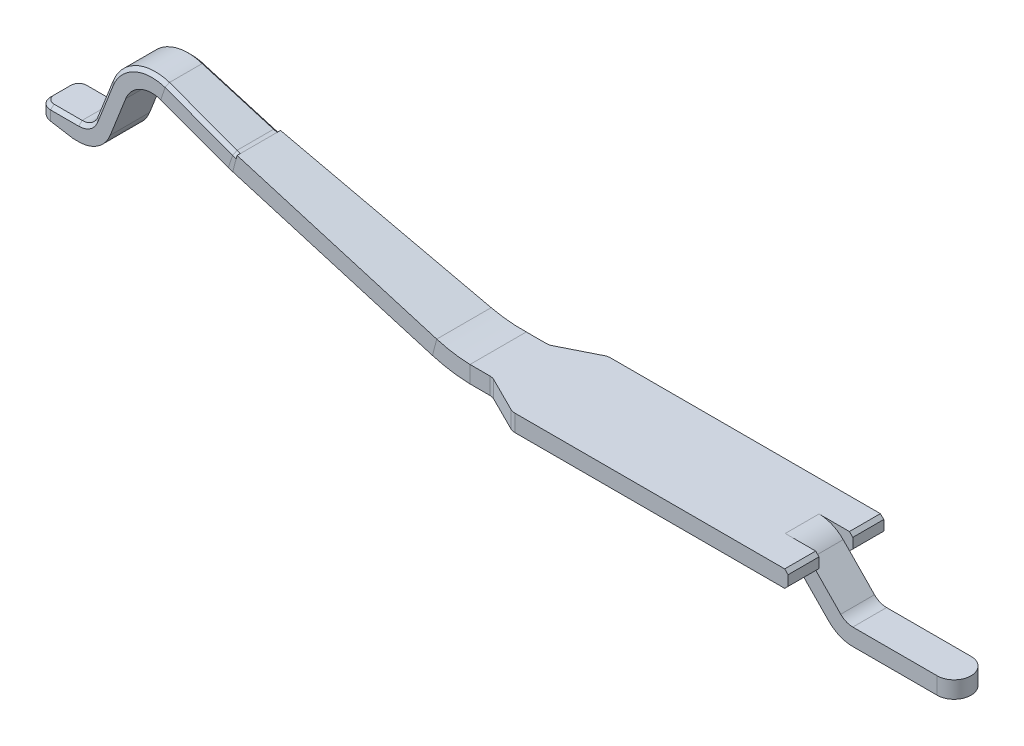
ISO-10303-21;
HEADER;
FILE_DESCRIPTION(('STEP AP214'),'2;1');
FILE_NAME('part.step','',(''),(''),'','','');
FILE_SCHEMA(('AUTOMOTIVE_DESIGN { 1 0 10303 214 1 1 1 1 }'));
ENDSEC;
DATA;
#1=APPLICATION_CONTEXT('core data for automotive mechanical design processes');
#2=APPLICATION_PROTOCOL_DEFINITION('international standard','automotive_design',2000,#1);
#3=PRODUCT_CONTEXT('',#1,'mechanical');
#4=PRODUCT('Part','Part','',(#3));
#5=PRODUCT_RELATED_PRODUCT_CATEGORY('part','',(#4));
#6=PRODUCT_DEFINITION_FORMATION('','',#4);
#7=PRODUCT_DEFINITION_CONTEXT('part definition',#1,'design');
#8=PRODUCT_DEFINITION('design','',#6,#7);
#9=PRODUCT_DEFINITION_SHAPE('','',#8);
#10=(LENGTH_UNIT() NAMED_UNIT(*) SI_UNIT(.MILLI.,.METRE.));
#11=(NAMED_UNIT(*) PLANE_ANGLE_UNIT() SI_UNIT($,.RADIAN.));
#12=(NAMED_UNIT(*) SI_UNIT($,.STERADIAN.) SOLID_ANGLE_UNIT());
#13=UNCERTAINTY_MEASURE_WITH_UNIT(LENGTH_MEASURE(1.E-05),#10,'distance_accuracy_value','');
#14=(GEOMETRIC_REPRESENTATION_CONTEXT(3) GLOBAL_UNCERTAINTY_ASSIGNED_CONTEXT((#13)) GLOBAL_UNIT_ASSIGNED_CONTEXT((#10,
#11,#12)) REPRESENTATION_CONTEXT('',''));
#15=CARTESIAN_POINT('',(0.,0.,0.));
#16=DIRECTION('',(0.,0.,1.));
#17=DIRECTION('',(1.,0.,0.));
#18=AXIS2_PLACEMENT_3D('',#15,#16,#17);
#19=CARTESIAN_POINT('',(3.150427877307,0.12,1.05));
#20=DIRECTION('',(0.,1.,0.));
#21=DIRECTION('',(-1.,0.,0.));
#22=AXIS2_PLACEMENT_3D('',#19,#20,#21);
#23=PLANE('',#22);
#24=DIRECTION('',(1.,0.,0.));
#25=VECTOR('',#24,1.);
#26=CARTESIAN_POINT('',(2.625,0.12,1.05));
#27=LINE('',#26,#25);
#28=CARTESIAN_POINT('',(3.,0.12,1.05));
#29=VERTEX_POINT('',#28);
#30=CARTESIAN_POINT('',(2.25,0.119999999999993,1.05));
#31=VERTEX_POINT('',#30);
#32=EDGE_CURVE('E363',#29,#31,#27,.F.);
#33=ORIENTED_EDGE('',*,*,#32,.T.);
#34=DIRECTION('',(0.,0.,1.));
#35=VECTOR('',#34,1.);
#36=CARTESIAN_POINT('',(2.25,0.12,1.2));
#37=LINE('',#36,#35);
#38=CARTESIAN_POINT('',(2.25,0.119999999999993,1.35));
#39=VERTEX_POINT('',#38);
#40=EDGE_CURVE('E357',#31,#39,#37,.T.);
#41=ORIENTED_EDGE('',*,*,#40,.T.);
#42=DIRECTION('',(1.,0.,0.));
#43=VECTOR('',#42,1.);
#44=CARTESIAN_POINT('',(2.625,0.12,1.35));
#45=LINE('',#44,#43);
#46=CARTESIAN_POINT('',(3.,0.12,1.35));
#47=VERTEX_POINT('',#46);
#48=EDGE_CURVE('E360',#39,#47,#45,.T.);
#49=ORIENTED_EDGE('',*,*,#48,.T.);
#50=CARTESIAN_POINT('',(3.,0.12,1.35));
#51=CARTESIAN_POINT('',(3.04923417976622,0.12,1.35));
#52=CARTESIAN_POINT('',(3.09,0.12,1.32));
#53=CARTESIAN_POINT('',(3.11564188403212,0.12,1.30112986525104));
#54=CARTESIAN_POINT('',(3.13235294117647,0.12,1.27058823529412));
#55=CARTESIAN_POINT('',(3.14955367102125,0.12,1.23915166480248));
#56=CARTESIAN_POINT('',(3.15,0.12,1.2));
#57=CARTESIAN_POINT('',(3.15040856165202,0.12,1.16416125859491));
#58=CARTESIAN_POINT('',(3.13235294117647,0.12,1.12941176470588));
#59=CARTESIAN_POINT('',(3.11766834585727,0.12,1.10115007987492));
#60=CARTESIAN_POINT('',(3.09,0.12,1.08));
#61=CARTESIAN_POINT('',(3.0507542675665,0.12,1.05));
#62=CARTESIAN_POINT('',(3.,0.12,1.05));
#63=B_SPLINE_CURVE_WITH_KNOTS('',2,(#50,#51,#52,#53,#54,#55,#56,#57,#58,#59,#60,#61,#62),
.UNSPECIFIED.,.F.,.F.,(3,2,2,2,2,2,3),(0.,0.25,0.375,0.5,0.625,0.75,1.),.UNSPECIFIED.);
#64=EDGE_CURVE('E366',#47,#29,#63,.T.);
#65=ORIENTED_EDGE('',*,*,#64,.T.);
#66=EDGE_LOOP('',(#33,#41,#49,#65));
#67=FACE_BOUND('',#66,.T.);
#68=ADVANCED_FACE('F17',(#67),#23,.T.);
#69=CARTESIAN_POINT('',(3.,-0.03,1.2));
#70=DIRECTION('',(0.,1.,0.));
#71=DIRECTION('',(0.,0.,1.));
#72=AXIS2_PLACEMENT_3D('',#69,#70,#71);
#73=CYLINDRICAL_SURFACE('',#72,0.15);
#74=ORIENTED_EDGE('',*,*,#64,.F.);
#75=DIRECTION('',(0.,-1.,0.));
#76=VECTOR('',#75,1.);
#77=CARTESIAN_POINT('',(3.,0.045,1.35));
#78=LINE('',#77,#76);
#79=CARTESIAN_POINT('',(3.,-0.03,1.35));
#80=VERTEX_POINT('',#79);
#81=EDGE_CURVE('E383',#80,#47,#78,.F.);
#82=ORIENTED_EDGE('',*,*,#81,.F.);
#83=CARTESIAN_POINT('',(3.,-0.03,1.2));
#84=DIRECTION('',(0.,1.,0.));
#85=DIRECTION('',(0.,0.,1.));
#86=AXIS2_PLACEMENT_3D('',#83,#84,#85);
#87=CIRCLE('',#86,0.15);
#88=CARTESIAN_POINT('',(3.,-0.03,1.05));
#89=VERTEX_POINT('',#88);
#90=EDGE_CURVE('E514',#80,#89,#87,.T.);
#91=ORIENTED_EDGE('',*,*,#90,.T.);
#92=DIRECTION('',(0.,-1.,0.));
#93=VECTOR('',#92,1.);
#94=CARTESIAN_POINT('',(3.,0.045,1.05));
#95=LINE('',#94,#93);
#96=EDGE_CURVE('E378',#89,#29,#95,.F.);
#97=ORIENTED_EDGE('',*,*,#96,.T.);
#98=EDGE_LOOP('',(#74,#82,#91,#97));
#99=FACE_BOUND('',#98,.T.);
#100=ADVANCED_FACE('F408',(#99),#73,.T.);
#101=CARTESIAN_POINT('',(2.25,0.269999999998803,1.05));
#102=DIRECTION('',(0.,0.,1.));
#103=DIRECTION('',(0.,-1.,0.));
#104=AXIS2_PLACEMENT_3D('',#101,#102,#103);
#105=CYLINDRICAL_SURFACE('',#104,0.14999999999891);
#106=CARTESIAN_POINT('',(2.25,0.269999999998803,1.05));
#107=DIRECTION('',(0.,0.,-1.));
#108=DIRECTION('',(0.,-1.,0.));
#109=AXIS2_PLACEMENT_3D('',#106,#107,#108);
#110=CIRCLE('',#109,0.14999999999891);
#111=CARTESIAN_POINT('',(2.14274307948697,0.165138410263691,1.05));
#112=VERTEX_POINT('',#111);
#113=EDGE_CURVE('E433',#31,#112,#110,.T.);
#114=ORIENTED_EDGE('',*,*,#113,.T.);
#115=DIRECTION('',(0.,0.,-1.));
#116=VECTOR('',#115,1.);
#117=CARTESIAN_POINT('',(2.142743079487,0.1651384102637,1.2));
#118=LINE('',#117,#116);
#119=CARTESIAN_POINT('',(2.14274307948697,0.165138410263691,1.35));
#120=VERTEX_POINT('',#119);
#121=EDGE_CURVE('E373',#112,#120,#118,.F.);
#122=ORIENTED_EDGE('',*,*,#121,.T.);
#123=CARTESIAN_POINT('',(2.25,0.269999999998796,1.35));
#124=DIRECTION('',(0.,0.,1.));
#125=DIRECTION('',(-0.715046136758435,-0.699077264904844,0.));
#126=AXIS2_PLACEMENT_3D('',#123,#124,#125);
#127=CIRCLE('',#126,0.149999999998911);
#128=EDGE_CURVE('E369',#120,#39,#127,.T.);
#129=ORIENTED_EDGE('',*,*,#128,.T.);
#130=ORIENTED_EDGE('',*,*,#40,.F.);
#131=EDGE_LOOP('',(#114,#122,#129,#130));
#132=FACE_BOUND('',#131,.T.);
#133=ADVANCED_FACE('F371',(#132),#105,.F.);
#134=CARTESIAN_POINT('',(3.150427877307,-0.03,1.05));
#135=DIRECTION('',(0.,1.,0.));
#136=DIRECTION('',(-1.,0.,0.));
#137=AXIS2_PLACEMENT_3D('',#134,#135,#136);
#138=PLANE('',#137);
#139=DIRECTION('',(-1.,0.,0.));
#140=VECTOR('',#139,1.);
#141=CARTESIAN_POINT('',(2.7002139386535,-0.03,1.05));
#142=LINE('',#141,#140);
#143=CARTESIAN_POINT('',(2.24999999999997,-0.0299999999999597,1.05));
#144=VERTEX_POINT('',#143);
#145=EDGE_CURVE('E449',#89,#144,#142,.T.);
#146=ORIENTED_EDGE('',*,*,#145,.F.);
#147=ORIENTED_EDGE('',*,*,#90,.F.);
#148=DIRECTION('',(1.,0.,0.));
#149=VECTOR('',#148,1.);
#150=CARTESIAN_POINT('',(2.7002139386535,-0.03,1.35));
#151=LINE('',#150,#149);
#152=CARTESIAN_POINT('',(2.24999999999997,-0.0299999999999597,1.35));
#153=VERTEX_POINT('',#152);
#154=EDGE_CURVE('E377',#153,#80,#151,.T.);
#155=ORIENTED_EDGE('',*,*,#154,.F.);
#156=DIRECTION('',(0.,0.,1.));
#157=VECTOR('',#156,1.);
#158=CARTESIAN_POINT('',(2.25,-0.03,1.2));
#159=LINE('',#158,#157);
#160=EDGE_CURVE('E508',#153,#144,#159,.F.);
#161=ORIENTED_EDGE('',*,*,#160,.T.);
#162=EDGE_LOOP('',(#146,#147,#155,#161));
#163=FACE_BOUND('',#162,.T.);
#164=ADVANCED_FACE('F531',(#163),#138,.F.);
#165=CARTESIAN_POINT('',(2.142743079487,0.1651384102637,1.05));
#166=DIRECTION('',(0.715046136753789,0.699077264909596,0.));
#167=DIRECTION('',(-0.699077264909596,0.715046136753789,0.));
#168=AXIS2_PLACEMENT_3D('',#165,#166,#167);
#169=PLANE('',#168);
#170=DIRECTION('',(0.699077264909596,-0.715046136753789,0.));
#171=VECTOR('',#170,1.);
#172=CARTESIAN_POINT('',(2.0036284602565,0.30743079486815,1.05));
#173=LINE('',#172,#171);
#174=CARTESIAN_POINT('',(1.864513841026,0.449723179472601,1.05));
#175=VERTEX_POINT('',#174);
#176=EDGE_CURVE('E447',#112,#175,#173,.F.);
#177=ORIENTED_EDGE('',*,*,#176,.T.);
#178=DIRECTION('',(0.,0.,-1.));
#179=VECTOR('',#178,1.);
#180=CARTESIAN_POINT('',(1.864513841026,0.4497231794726,1.2));
#181=LINE('',#180,#179);
#182=CARTESIAN_POINT('',(1.864513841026,0.449723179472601,1.35));
#183=VERTEX_POINT('',#182);
#184=EDGE_CURVE('E458',#175,#183,#181,.F.);
#185=ORIENTED_EDGE('',*,*,#184,.T.);
#186=DIRECTION('',(0.699077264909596,-0.715046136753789,0.));
#187=VECTOR('',#186,1.);
#188=CARTESIAN_POINT('',(2.0036284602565,0.30743079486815,1.35));
#189=LINE('',#188,#187);
#190=EDGE_CURVE('E444',#183,#120,#189,.T.);
#191=ORIENTED_EDGE('',*,*,#190,.T.);
#192=ORIENTED_EDGE('',*,*,#121,.F.);
#193=EDGE_LOOP('',(#177,#185,#191,#192));
#194=FACE_BOUND('',#193,.T.);
#195=ADVANCED_FACE('F446',(#194),#169,.T.);
#196=CARTESIAN_POINT('',(2.25,0.269999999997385,1.05));
#197=DIRECTION('',(0.,0.,1.));
#198=DIRECTION('',(0.,-1.,0.));
#199=AXIS2_PLACEMENT_3D('',#196,#197,#198);
#200=CYLINDRICAL_SURFACE('',#199,0.299999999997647);
#201=CARTESIAN_POINT('',(2.25,-0.03,1.05));
#202=CARTESIAN_POINT('',(2.18980658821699,-0.03,1.05));
#203=CARTESIAN_POINT('',(2.13363194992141,-0.00651126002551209,1.05));
#204=CARTESIAN_POINT('',(2.07806827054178,0.0167220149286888,1.05));
#205=CARTESIAN_POINT('',(2.035486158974,0.06027682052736,1.05));
#206=B_SPLINE_CURVE_WITH_KNOTS('',2,(#201,#202,#203,#204,#205),.UNSPECIFIED.,.F.,.F.,(3,2,3),
(0.,0.5,1.),.UNSPECIFIED.);
#207=CARTESIAN_POINT('',(2.035486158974,0.06027682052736,1.05));
#208=VERTEX_POINT('',#207);
#209=EDGE_CURVE('E462',#144,#208,#206,.T.);
#210=ORIENTED_EDGE('',*,*,#209,.F.);
#211=ORIENTED_EDGE('',*,*,#160,.F.);
#212=CARTESIAN_POINT('',(2.035486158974,0.06027682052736,1.35));
#213=CARTESIAN_POINT('',(2.0775660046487,0.0172357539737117,1.35));
#214=CARTESIAN_POINT('',(2.13363194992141,-0.00651126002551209,1.35));
#215=CARTESIAN_POINT('',(2.18908811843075,-0.03,1.35));
#216=CARTESIAN_POINT('',(2.25,-0.03,1.35));
#217=B_SPLINE_CURVE_WITH_KNOTS('',2,(#212,#213,#214,#215,#216),.UNSPECIFIED.,.F.,.F.,(3,2,3),
(0.,0.5,1.),.UNSPECIFIED.);
#218=CARTESIAN_POINT('',(2.035486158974,0.06027682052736,1.35));
#219=VERTEX_POINT('',#218);
#220=EDGE_CURVE('E482',#219,#153,#217,.T.);
#221=ORIENTED_EDGE('',*,*,#220,.F.);
#222=DIRECTION('',(0.,0.,-1.));
#223=VECTOR('',#222,1.);
#224=CARTESIAN_POINT('',(2.035486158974,0.06027682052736,1.2));
#225=LINE('',#224,#223);
#226=EDGE_CURVE('E474',#219,#208,#225,.T.);
#227=ORIENTED_EDGE('',*,*,#226,.T.);
#228=EDGE_LOOP('',(#210,#211,#221,#227));
#229=FACE_BOUND('',#228,.T.);
#230=ADVANCED_FACE('F539',(#229),#200,.T.);
#231=CARTESIAN_POINT('',(1.65,0.240000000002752,1.05));
#232=DIRECTION('',(0.,0.,1.));
#233=DIRECTION('',(0.,-1.,0.));
#234=AXIS2_PLACEMENT_3D('',#231,#232,#233);
#235=CYLINDRICAL_SURFACE('',#234,0.299999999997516);
#236=CARTESIAN_POINT('',(1.65,0.240000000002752,1.05));
#237=DIRECTION('',(0.,0.,1.));
#238=DIRECTION('',(0.715046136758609,0.699077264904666,0.));
#239=AXIS2_PLACEMENT_3D('',#236,#237,#238);
#240=CIRCLE('',#239,0.299999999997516);
#241=CARTESIAN_POINT('',(1.65,0.54,1.05));
#242=VERTEX_POINT('',#241);
#243=EDGE_CURVE('E455',#175,#242,#240,.T.);
#244=ORIENTED_EDGE('',*,*,#243,.T.);
#245=DIRECTION('',(0.,0.,-1.));
#246=VECTOR('',#245,1.);
#247=CARTESIAN_POINT('',(1.65,0.54,1.2));
#248=LINE('',#247,#246);
#249=CARTESIAN_POINT('',(1.65,0.54,1.35));
#250=VERTEX_POINT('',#249);
#251=EDGE_CURVE('E460',#242,#250,#248,.F.);
#252=ORIENTED_EDGE('',*,*,#251,.T.);
#253=CARTESIAN_POINT('',(1.65,0.240000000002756,1.35));
#254=DIRECTION('',(0.,0.,-1.));
#255=DIRECTION('',(0.,1.,0.));
#256=AXIS2_PLACEMENT_3D('',#253,#254,#255);
#257=CIRCLE('',#256,0.299999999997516);
#258=EDGE_CURVE('E587',#250,#183,#257,.T.);
#259=ORIENTED_EDGE('',*,*,#258,.T.);
#260=ORIENTED_EDGE('',*,*,#184,.F.);
#261=EDGE_LOOP('',(#244,#252,#259,#260));
#262=FACE_BOUND('',#261,.T.);
#263=ADVANCED_FACE('F561',(#262),#235,.T.);
#264=CARTESIAN_POINT('',(1.92,0.54,0.775));
#265=DIRECTION('',(0.,1.,0.));
#266=DIRECTION('',(-1.,0.,0.));
#267=AXIS2_PLACEMENT_3D('',#264,#265,#266);
#268=PLANE('',#267);
#269=CARTESIAN_POINT('',(-0.47639320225,0.54,0.775));
#270=CARTESIAN_POINT('',(-0.5,0.54,0.775));
#271=CARTESIAN_POINT('',(-0.5211145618,0.54,0.7855572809));
#272=B_SPLINE_CURVE_WITH_KNOTS('',2,(#269,#270,#271),.UNSPECIFIED.,.F.,.F.,(3,3),(0.,1.),.UNSPECIFIED.);
#273=CARTESIAN_POINT('',(-0.47639320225,0.54,0.775));
#274=VERTEX_POINT('',#273);
#275=CARTESIAN_POINT('',(-0.5211145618,0.54,0.785557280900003));
#276=VERTEX_POINT('',#275);
#277=EDGE_CURVE('E600',#274,#276,#272,.T.);
#278=ORIENTED_EDGE('',*,*,#277,.T.);
#279=DIRECTION('',(0.894427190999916,0.,-0.447213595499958));
#280=VECTOR('',#279,1.);
#281=CARTESIAN_POINT('',(-0.675,0.54,0.8625));
#282=LINE('',#281,#280);
#283=CARTESIAN_POINT('',(-0.8288854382,0.54,0.939442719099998));
#284=VERTEX_POINT('',#283);
#285=EDGE_CURVE('E1702',#276,#284,#282,.F.);
#286=ORIENTED_EDGE('',*,*,#285,.T.);
#287=CARTESIAN_POINT('',(-0.87360679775,0.540000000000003,0.849999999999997));
#288=DIRECTION('',(0.,1.,0.));
#289=DIRECTION('',(0.,0.,1.));
#290=AXIS2_PLACEMENT_3D('',#287,#288,#289);
#291=CIRCLE('',#290,0.100000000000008);
#292=CARTESIAN_POINT('',(-0.87360679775,0.54,0.95));
#293=VERTEX_POINT('',#292);
#294=EDGE_CURVE('E495',#293,#284,#291,.T.);
#295=ORIENTED_EDGE('',*,*,#294,.F.);
#296=DIRECTION('',(-1.,0.,0.));
#297=VECTOR('',#296,1.);
#298=CARTESIAN_POINT('',(0.435,0.54,0.95));
#299=LINE('',#298,#297);
#300=CARTESIAN_POINT('',(-1.05,0.54,0.95));
#301=VERTEX_POINT('',#300);
#302=EDGE_CURVE('E487',#301,#293,#299,.F.);
#303=ORIENTED_EDGE('',*,*,#302,.F.);
#304=DIRECTION('',(0.,0.,1.));
#305=VECTOR('',#304,1.);
#306=CARTESIAN_POINT('',(-1.05,0.54,1.2));
#307=LINE('',#306,#305);
#308=CARTESIAN_POINT('',(-1.05,0.54,1.45));
#309=VERTEX_POINT('',#308);
#310=EDGE_CURVE('E485',#309,#301,#307,.F.);
#311=ORIENTED_EDGE('',*,*,#310,.F.);
#312=DIRECTION('',(1.,0.,0.));
#313=VECTOR('',#312,1.);
#314=CARTESIAN_POINT('',(0.435,0.54,1.45));
#315=LINE('',#314,#313);
#316=CARTESIAN_POINT('',(-0.87360679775,0.54,1.45));
#317=VERTEX_POINT('',#316);
#318=EDGE_CURVE('E488',#317,#309,#315,.F.);
#319=ORIENTED_EDGE('',*,*,#318,.F.);
#320=CARTESIAN_POINT('',(-0.873606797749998,0.540000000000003,1.54999999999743));
#321=DIRECTION('',(0.,1.,0.));
#322=DIRECTION('',(0.447213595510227,0.,-0.894427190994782));
#323=AXIS2_PLACEMENT_3D('',#320,#321,#322);
#324=CIRCLE('',#323,0.0999999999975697);
#325=CARTESIAN_POINT('',(-0.8288854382,0.54,1.4605572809));
#326=VERTEX_POINT('',#325);
#327=EDGE_CURVE('E500',#326,#317,#324,.T.);
#328=ORIENTED_EDGE('',*,*,#327,.F.);
#329=DIRECTION('',(-0.894427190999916,0.,-0.447213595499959));
#330=VECTOR('',#329,1.);
#331=CARTESIAN_POINT('',(-0.675,0.54,1.5375));
#332=LINE('',#331,#330);
#333=CARTESIAN_POINT('',(-0.5211145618,0.54,1.6144427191));
#334=VERTEX_POINT('',#333);
#335=EDGE_CURVE('E1689',#326,#334,#332,.F.);
#336=ORIENTED_EDGE('',*,*,#335,.T.);
#337=CARTESIAN_POINT('',(-0.5211145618,0.54,1.6144427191));
#338=CARTESIAN_POINT('',(-0.500000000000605,0.54,1.625));
#339=CARTESIAN_POINT('',(-0.47639320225,0.54,1.625));
#340=B_SPLINE_CURVE_WITH_KNOTS('',2,(#337,#338,#339),.UNSPECIFIED.,.F.,.F.,(3,3),(0.,1.),.UNSPECIFIED.);
#341=CARTESIAN_POINT('',(-0.47639320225,0.54,1.625));
#342=VERTEX_POINT('',#341);
#343=EDGE_CURVE('E635',#334,#342,#340,.T.);
#344=ORIENTED_EDGE('',*,*,#343,.T.);
#345=DIRECTION('',(-1.,0.,0.));
#346=VECTOR('',#345,1.);
#347=CARTESIAN_POINT('',(0.386803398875,0.54,1.625));
#348=LINE('',#347,#346);
#349=CARTESIAN_POINT('',(1.92,0.54,1.625));
#350=VERTEX_POINT('',#349);
#351=EDGE_CURVE('E1678',#342,#350,#348,.F.);
#352=ORIENTED_EDGE('',*,*,#351,.T.);
#353=DIRECTION('',(0.,0.,-1.));
#354=VECTOR('',#353,1.);
#355=CARTESIAN_POINT('',(1.92,0.54,1.4875));
#356=LINE('',#355,#354);
#357=CARTESIAN_POINT('',(1.92,0.54,1.35));
#358=VERTEX_POINT('',#357);
#359=EDGE_CURVE('E491',#350,#358,#356,.T.);
#360=ORIENTED_EDGE('',*,*,#359,.T.);
#361=DIRECTION('',(-1.,0.,0.));
#362=VECTOR('',#361,1.);
#363=CARTESIAN_POINT('',(0.435,0.54,1.35));
#364=LINE('',#363,#362);
#365=EDGE_CURVE('E498',#250,#358,#364,.F.);
#366=ORIENTED_EDGE('',*,*,#365,.F.);
#367=ORIENTED_EDGE('',*,*,#251,.F.);
#368=DIRECTION('',(1.,0.,0.));
#369=VECTOR('',#368,1.);
#370=CARTESIAN_POINT('',(0.435,0.54,1.05));
#371=LINE('',#370,#369);
#372=CARTESIAN_POINT('',(1.92,0.54,1.05));
#373=VERTEX_POINT('',#372);
#374=EDGE_CURVE('E457',#373,#242,#371,.F.);
#375=ORIENTED_EDGE('',*,*,#374,.F.);
#376=DIRECTION('',(0.,0.,-1.));
#377=VECTOR('',#376,1.);
#378=CARTESIAN_POINT('',(1.92,0.54,0.9125));
#379=LINE('',#378,#377);
#380=CARTESIAN_POINT('',(1.92,0.54,0.775));
#381=VERTEX_POINT('',#380);
#382=EDGE_CURVE('E1761',#373,#381,#379,.T.);
#383=ORIENTED_EDGE('',*,*,#382,.T.);
#384=DIRECTION('',(1.,0.,0.));
#385=VECTOR('',#384,1.);
#386=CARTESIAN_POINT('',(0.386803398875,0.54,0.775));
#387=LINE('',#386,#385);
#388=EDGE_CURVE('E1708',#381,#274,#387,.F.);
#389=ORIENTED_EDGE('',*,*,#388,.T.);
#390=EDGE_LOOP('',(#278,#286,#295,#303,#311,#319,#328,#336,#344,#352,#360,#366,#367,#375,#383,#389));
#391=FACE_BOUND('',#390,.T.);
#392=ADVANCED_FACE('F607',(#391),#268,.T.);
#393=CARTESIAN_POINT('',(1.95,0.42,1.625));
#394=DIRECTION('',(1.,0.,0.));
#395=DIRECTION('',(0.,0.,-1.));
#396=AXIS2_PLACEMENT_3D('',#393,#394,#395);
#397=PLANE('',#396);
#398=DIRECTION('',(0.,0.,1.));
#399=VECTOR('',#398,1.);
#400=CARTESIAN_POINT('',(1.95,0.42,1.4875));
#401=LINE('',#400,#399);
#402=CARTESIAN_POINT('',(1.95,0.42,1.625));
#403=VERTEX_POINT('',#402);
#404=CARTESIAN_POINT('',(1.95,0.42,1.35));
#405=VERTEX_POINT('',#404);
#406=EDGE_CURVE('E1675',#403,#405,#401,.F.);
#407=ORIENTED_EDGE('',*,*,#406,.T.);
#408=DIRECTION('',(0.,-1.,0.));
#409=VECTOR('',#408,1.);
#410=CARTESIAN_POINT('',(1.95,0.465,1.35));
#411=LINE('',#410,#409);
#412=CARTESIAN_POINT('',(1.95,0.51,1.35));
#413=VERTEX_POINT('',#412);
#414=EDGE_CURVE('E2814',#405,#413,#411,.F.);
#415=ORIENTED_EDGE('',*,*,#414,.T.);
#416=DIRECTION('',(0.,0.,1.));
#417=VECTOR('',#416,1.);
#418=CARTESIAN_POINT('',(1.95,0.51,1.4875));
#419=LINE('',#418,#417);
#420=CARTESIAN_POINT('',(1.95,0.51,1.625));
#421=VERTEX_POINT('',#420);
#422=EDGE_CURVE('E494',#413,#421,#419,.T.);
#423=ORIENTED_EDGE('',*,*,#422,.T.);
#424=DIRECTION('',(0.,-1.,0.));
#425=VECTOR('',#424,1.);
#426=CARTESIAN_POINT('',(1.95,0.465,1.625));
#427=LINE('',#426,#425);
#428=EDGE_CURVE('E815',#421,#403,#427,.T.);
#429=ORIENTED_EDGE('',*,*,#428,.T.);
#430=EDGE_LOOP('',(#407,#415,#423,#429));
#431=FACE_BOUND('',#430,.T.);
#432=ADVANCED_FACE('F616',(#431),#397,.T.);
#433=CARTESIAN_POINT('',(1.92,0.54,1.625));
#434=DIRECTION('',(-0.707106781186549,-0.707106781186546,0.));
#435=DIRECTION('',(0.,0.,-1.));
#436=AXIS2_PLACEMENT_3D('',#433,#434,#435);
#437=PLANE('',#436);
#438=ORIENTED_EDGE('',*,*,#422,.F.);
#439=CARTESIAN_POINT('',(1.95,0.51,1.35));
#440=DIRECTION('',(-0.707106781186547,0.707106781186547,0.));
#441=VECTOR('',#440,1.);
#442=LINE('',#439,#441);
#443=EDGE_CURVE('E2823',#413,#358,#442,.T.);
#444=ORIENTED_EDGE('',*,*,#443,.T.);
#445=ORIENTED_EDGE('',*,*,#359,.F.);
#446=CARTESIAN_POINT('',(1.92,0.54,1.625));
#447=DIRECTION('',(0.707106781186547,-0.707106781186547,0.));
#448=VECTOR('',#447,1.);
#449=LINE('',#446,#448);
#450=EDGE_CURVE('E791',#350,#421,#449,.T.);
#451=ORIENTED_EDGE('',*,*,#450,.T.);
#452=EDGE_LOOP('',(#438,#444,#445,#451));
#453=FACE_BOUND('',#452,.T.);
#454=ADVANCED_FACE('F662',(#453),#437,.F.);
#455=CARTESIAN_POINT('',(1.65,0.3448615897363,1.35));
#456=DIRECTION('',(0.,0.,1.));
#457=DIRECTION('',(1.,0.,0.));
#458=AXIS2_PLACEMENT_3D('',#455,#456,#457);
#459=PLANE('',#458);
#460=CARTESIAN_POINT('',(1.65,0.39,1.35));
#461=CARTESIAN_POINT('',(1.7131265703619,0.39,1.35));
#462=CARTESIAN_POINT('',(1.757256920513,0.3448615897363,1.35));
#463=B_SPLINE_CURVE_WITH_KNOTS('',2,(#460,#461,#462),.UNSPECIFIED.,.F.,.F.,(3,3),(0.,1.),.UNSPECIFIED.);
#464=CARTESIAN_POINT('',(1.65,0.39,1.35));
#465=VERTEX_POINT('',#464);
#466=CARTESIAN_POINT('',(1.75725692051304,0.3448615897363,1.35));
#467=VERTEX_POINT('',#466);
#468=EDGE_CURVE('E647',#465,#467,#463,.T.);
#469=ORIENTED_EDGE('',*,*,#468,.T.);
#470=DIRECTION('',(0.699077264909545,-0.715046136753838,0.));
#471=VECTOR('',#470,1.);
#472=CARTESIAN_POINT('',(1.8963715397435,0.20256920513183,1.35));
#473=LINE('',#472,#471);
#474=EDGE_CURVE('E478',#467,#219,#473,.T.);
#475=ORIENTED_EDGE('',*,*,#474,.T.);
#476=ORIENTED_EDGE('',*,*,#220,.T.);
#477=ORIENTED_EDGE('',*,*,#154,.T.);
#478=ORIENTED_EDGE('',*,*,#81,.T.);
#479=ORIENTED_EDGE('',*,*,#48,.F.);
#480=ORIENTED_EDGE('',*,*,#128,.F.);
#481=ORIENTED_EDGE('',*,*,#190,.F.);
#482=ORIENTED_EDGE('',*,*,#258,.F.);
#483=DIRECTION('',(0.,1.,0.));
#484=VECTOR('',#483,1.);
#485=CARTESIAN_POINT('',(1.65,0.465,1.35));
#486=LINE('',#485,#484);
#487=EDGE_CURVE('E1781',#250,#465,#486,.F.);
#488=ORIENTED_EDGE('',*,*,#487,.T.);
#489=EDGE_LOOP('',(#469,#475,#476,#477,#478,#479,#480,#481,#482,#488));
#490=FACE_BOUND('',#489,.T.);
#491=ADVANCED_FACE('F381',(#490),#459,.T.);
#492=CARTESIAN_POINT('',(2.035486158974,0.06027682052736,1.05));
#493=DIRECTION('',(0.715046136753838,0.699077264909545,0.));
#494=DIRECTION('',(-0.699077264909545,0.715046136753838,0.));
#495=AXIS2_PLACEMENT_3D('',#492,#493,#494);
#496=PLANE('',#495);
#497=DIRECTION('',(-0.699077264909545,0.715046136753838,0.));
#498=VECTOR('',#497,1.);
#499=CARTESIAN_POINT('',(1.8963715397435,0.20256920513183,1.05));
#500=LINE('',#499,#498);
#501=CARTESIAN_POINT('',(1.75725692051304,0.3448615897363,1.05));
#502=VERTEX_POINT('',#501);
#503=EDGE_CURVE('E477',#208,#502,#500,.T.);
#504=ORIENTED_EDGE('',*,*,#503,.F.);
#505=ORIENTED_EDGE('',*,*,#226,.F.);
#506=ORIENTED_EDGE('',*,*,#474,.F.);
#507=DIRECTION('',(0.,0.,-1.));
#508=VECTOR('',#507,1.);
#509=CARTESIAN_POINT('',(1.757256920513,0.3448615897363,1.2));
#510=LINE('',#509,#508);
#511=EDGE_CURVE('E1766',#467,#502,#510,.T.);
#512=ORIENTED_EDGE('',*,*,#511,.T.);
#513=EDGE_LOOP('',(#504,#505,#506,#512));
#514=FACE_BOUND('',#513,.T.);
#515=ADVANCED_FACE('F661',(#514),#496,.F.);
#516=CARTESIAN_POINT('',(1.92,0.54,1.05));
#517=DIRECTION('',(-0.707106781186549,-0.707106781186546,0.));
#518=DIRECTION('',(0.,0.,-1.));
#519=AXIS2_PLACEMENT_3D('',#516,#517,#518);
#520=PLANE('',#519);
#521=DIRECTION('',(0.,0.,1.));
#522=VECTOR('',#521,1.);
#523=CARTESIAN_POINT('',(1.95,0.51,0.9125));
#524=LINE('',#523,#522);
#525=CARTESIAN_POINT('',(1.95,0.51,1.05));
#526=VERTEX_POINT('',#525);
#527=CARTESIAN_POINT('',(1.95,0.51,0.775));
#528=VERTEX_POINT('',#527);
#529=EDGE_CURVE('E1731',#526,#528,#524,.F.);
#530=ORIENTED_EDGE('',*,*,#529,.T.);
#531=CARTESIAN_POINT('',(1.95,0.51,0.775));
#532=DIRECTION('',(-0.707106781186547,0.707106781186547,0.));
#533=VECTOR('',#532,1.);
#534=LINE('',#531,#533);
#535=EDGE_CURVE('E1730',#528,#381,#534,.T.);
#536=ORIENTED_EDGE('',*,*,#535,.T.);
#537=ORIENTED_EDGE('',*,*,#382,.F.);
#538=CARTESIAN_POINT('',(1.92,0.54,1.05));
#539=DIRECTION('',(0.707106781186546,-0.707106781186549,0.));
#540=VECTOR('',#539,1.);
#541=LINE('',#538,#540);
#542=EDGE_CURVE('E892',#373,#526,#541,.T.);
#543=ORIENTED_EDGE('',*,*,#542,.T.);
#544=EDGE_LOOP('',(#530,#536,#537,#543));
#545=FACE_BOUND('',#544,.T.);
#546=ADVANCED_FACE('F694',(#545),#520,.F.);
#547=CARTESIAN_POINT('',(1.65,0.3448615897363,1.05));
#548=DIRECTION('',(0.,0.,1.));
#549=DIRECTION('',(1.,0.,0.));
#550=AXIS2_PLACEMENT_3D('',#547,#548,#549);
#551=PLANE('',#550);
#552=CARTESIAN_POINT('',(1.757256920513,0.3448615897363,1.05));
#553=CARTESIAN_POINT('',(1.7131265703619,0.39,1.05));
#554=CARTESIAN_POINT('',(1.65,0.39,1.05));
#555=B_SPLINE_CURVE_WITH_KNOTS('',2,(#552,#553,#554),.UNSPECIFIED.,.F.,.F.,(3,3),(0.,1.),.UNSPECIFIED.);
#556=CARTESIAN_POINT('',(1.65,0.39,1.05));
#557=VERTEX_POINT('',#556);
#558=EDGE_CURVE('E869',#502,#557,#555,.T.);
#559=ORIENTED_EDGE('',*,*,#558,.T.);
#560=DIRECTION('',(0.,-1.,0.));
#561=VECTOR('',#560,1.);
#562=CARTESIAN_POINT('',(1.65,0.465,1.05));
#563=LINE('',#562,#561);
#564=EDGE_CURVE('E1740',#557,#242,#563,.F.);
#565=ORIENTED_EDGE('',*,*,#564,.T.);
#566=ORIENTED_EDGE('',*,*,#243,.F.);
#567=ORIENTED_EDGE('',*,*,#176,.F.);
#568=ORIENTED_EDGE('',*,*,#113,.F.);
#569=ORIENTED_EDGE('',*,*,#32,.F.);
#570=ORIENTED_EDGE('',*,*,#96,.F.);
#571=ORIENTED_EDGE('',*,*,#145,.T.);
#572=ORIENTED_EDGE('',*,*,#209,.T.);
#573=ORIENTED_EDGE('',*,*,#503,.T.);
#574=EDGE_LOOP('',(#559,#565,#566,#567,#568,#569,#570,#571,#572,#573));
#575=FACE_BOUND('',#574,.T.);
#576=ADVANCED_FACE('F452',(#575),#551,.F.);
#577=CARTESIAN_POINT('',(1.95,0.42,1.05));
#578=DIRECTION('',(1.,0.,0.));
#579=DIRECTION('',(0.,0.,-1.));
#580=AXIS2_PLACEMENT_3D('',#577,#578,#579);
#581=PLANE('',#580);
#582=DIRECTION('',(0.,0.,1.));
#583=VECTOR('',#582,1.);
#584=CARTESIAN_POINT('',(1.95,0.42,0.9125));
#585=LINE('',#584,#583);
#586=CARTESIAN_POINT('',(1.95,0.42,1.05));
#587=VERTEX_POINT('',#586);
#588=CARTESIAN_POINT('',(1.95,0.42,0.775));
#589=VERTEX_POINT('',#588);
#590=EDGE_CURVE('E1718',#587,#589,#585,.F.);
#591=ORIENTED_EDGE('',*,*,#590,.T.);
#592=DIRECTION('',(0.,-1.,0.));
#593=VECTOR('',#592,1.);
#594=CARTESIAN_POINT('',(1.95,0.465,0.775));
#595=LINE('',#594,#593);
#596=EDGE_CURVE('E1727',#589,#528,#595,.F.);
#597=ORIENTED_EDGE('',*,*,#596,.T.);
#598=ORIENTED_EDGE('',*,*,#529,.F.);
#599=DIRECTION('',(0.,1.,0.));
#600=VECTOR('',#599,1.);
#601=CARTESIAN_POINT('',(1.95,0.465,1.05));
#602=LINE('',#601,#600);
#603=EDGE_CURVE('E1743',#526,#587,#602,.F.);
#604=ORIENTED_EDGE('',*,*,#603,.T.);
#605=EDGE_LOOP('',(#591,#597,#598,#604));
#606=FACE_BOUND('',#605,.T.);
#607=ADVANCED_FACE('F693',(#606),#581,.T.);
#608=CARTESIAN_POINT('',(1.25,0.39,0.775));
#609=DIRECTION('',(0.,0.,-1.));
#610=DIRECTION('',(-1.,0.,0.));
#611=AXIS2_PLACEMENT_3D('',#608,#609,#610);
#612=PLANE('',#611);
#613=ORIENTED_EDGE('',*,*,#388,.F.);
#614=ORIENTED_EDGE('',*,*,#535,.F.);
#615=ORIENTED_EDGE('',*,*,#596,.F.);
#616=DIRECTION('',(0.707106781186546,0.707106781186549,0.));
#617=VECTOR('',#616,1.);
#618=CARTESIAN_POINT('',(1.935,0.405,0.775));
#619=LINE('',#618,#617);
#620=CARTESIAN_POINT('',(1.92,0.39,0.775));
#621=VERTEX_POINT('',#620);
#622=EDGE_CURVE('E1697',#589,#621,#619,.F.);
#623=ORIENTED_EDGE('',*,*,#622,.T.);
#624=DIRECTION('',(-1.,0.,0.));
#625=VECTOR('',#624,1.);
#626=CARTESIAN_POINT('',(0.435,0.39,0.775));
#627=LINE('',#626,#625);
#628=CARTESIAN_POINT('',(-0.47639320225,0.39,0.775));
#629=VERTEX_POINT('',#628);
#630=EDGE_CURVE('E1655',#621,#629,#627,.T.);
#631=ORIENTED_EDGE('',*,*,#630,.T.);
#632=DIRECTION('',(0.,-1.,0.));
#633=VECTOR('',#632,1.);
#634=CARTESIAN_POINT('',(-0.47639320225,0.465,0.775));
#635=LINE('',#634,#633);
#636=EDGE_CURVE('E1705',#629,#274,#635,.F.);
#637=ORIENTED_EDGE('',*,*,#636,.T.);
#638=EDGE_LOOP('',(#613,#614,#615,#623,#631,#637));
#639=FACE_BOUND('',#638,.T.);
#640=ADVANCED_FACE('F720',(#639),#612,.T.);
#641=CARTESIAN_POINT('',(-0.476393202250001,0.389999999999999,0.874999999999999));
#642=DIRECTION('',(0.,1.,0.));
#643=DIRECTION('',(0.,0.,1.));
#644=AXIS2_PLACEMENT_3D('',#641,#642,#643);
#645=CYLINDRICAL_SURFACE('',#644,0.100000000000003);
#646=DIRECTION('',(0.,-1.,0.));
#647=VECTOR('',#646,1.);
#648=CARTESIAN_POINT('',(-0.5211145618,0.465,0.7855572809));
#649=LINE('',#648,#647);
#650=CARTESIAN_POINT('',(-0.5211145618,0.39,0.785557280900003));
#651=VERTEX_POINT('',#650);
#652=EDGE_CURVE('E1700',#651,#276,#649,.F.);
#653=ORIENTED_EDGE('',*,*,#652,.T.);
#654=ORIENTED_EDGE('',*,*,#277,.F.);
#655=ORIENTED_EDGE('',*,*,#636,.F.);
#656=CARTESIAN_POINT('',(-0.476393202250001,0.389999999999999,0.874999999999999));
#657=DIRECTION('',(0.,1.,0.));
#658=DIRECTION('',(0.,0.,-1.));
#659=AXIS2_PLACEMENT_3D('',#656,#657,#658);
#660=CIRCLE('',#659,0.100000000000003);
#661=EDGE_CURVE('E1662',#629,#651,#660,.T.);
#662=ORIENTED_EDGE('',*,*,#661,.T.);
#663=EDGE_LOOP('',(#653,#654,#655,#662));
#664=FACE_BOUND('',#663,.T.);
#665=ADVANCED_FACE('F729',(#664),#645,.T.);
#666=CARTESIAN_POINT('',(-0.5211145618,0.39,0.7855572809));
#667=DIRECTION('',(-0.447213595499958,0.,-0.894427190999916));
#668=DIRECTION('',(-0.894427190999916,0.,0.447213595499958));
#669=AXIS2_PLACEMENT_3D('',#666,#667,#668);
#670=PLANE('',#669);
#671=CARTESIAN_POINT('',(-0.5211145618,0.39,0.7855572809));
#672=DIRECTION('',(-0.894427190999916,0.,0.447213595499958));
#673=VECTOR('',#672,1.);
#674=LINE('',#671,#673);
#675=CARTESIAN_POINT('',(-0.8288854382,0.39,0.939442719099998));
#676=VERTEX_POINT('',#675);
#677=EDGE_CURVE('E1020',#651,#676,#674,.T.);
#678=ORIENTED_EDGE('',*,*,#677,.T.);
#679=DIRECTION('',(0.,1.,0.));
#680=VECTOR('',#679,1.);
#681=CARTESIAN_POINT('',(-0.8288854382,0.465,0.9394427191));
#682=LINE('',#681,#680);
#683=EDGE_CURVE('E1693',#676,#284,#682,.T.);
#684=ORIENTED_EDGE('',*,*,#683,.T.);
#685=ORIENTED_EDGE('',*,*,#285,.F.);
#686=ORIENTED_EDGE('',*,*,#652,.F.);
#687=EDGE_LOOP('',(#678,#684,#685,#686));
#688=FACE_BOUND('',#687,.T.);
#689=ADVANCED_FACE('F734',(#688),#670,.T.);
#690=CARTESIAN_POINT('',(-0.8288854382,0.39,1.4605572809));
#691=DIRECTION('',(-0.447213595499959,0.,0.894427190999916));
#692=DIRECTION('',(0.894427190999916,0.,0.447213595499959));
#693=AXIS2_PLACEMENT_3D('',#690,#691,#692);
#694=PLANE('',#693);
#695=CARTESIAN_POINT('',(-0.8288854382,0.39,1.4605572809));
#696=DIRECTION('',(0.894427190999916,0.,0.447213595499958));
#697=VECTOR('',#696,1.);
#698=LINE('',#695,#697);
#699=CARTESIAN_POINT('',(-0.8288854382,0.39,1.4605572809));
#700=VERTEX_POINT('',#699);
#701=CARTESIAN_POINT('',(-0.5211145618,0.39,1.6144427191));
#702=VERTEX_POINT('',#701);
#703=EDGE_CURVE('E2837',#700,#702,#698,.T.);
#704=ORIENTED_EDGE('',*,*,#703,.T.);
#705=DIRECTION('',(0.,-1.,0.));
#706=VECTOR('',#705,1.);
#707=CARTESIAN_POINT('',(-0.5211145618,0.465,1.6144427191));
#708=LINE('',#707,#706);
#709=EDGE_CURVE('E1686',#702,#334,#708,.F.);
#710=ORIENTED_EDGE('',*,*,#709,.T.);
#711=ORIENTED_EDGE('',*,*,#335,.F.);
#712=DIRECTION('',(0.,-1.,0.));
#713=VECTOR('',#712,1.);
#714=CARTESIAN_POINT('',(-0.8288854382,0.465,1.4605572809));
#715=LINE('',#714,#713);
#716=EDGE_CURVE('E1663',#326,#700,#715,.T.);
#717=ORIENTED_EDGE('',*,*,#716,.T.);
#718=EDGE_LOOP('',(#704,#710,#711,#717));
#719=FACE_BOUND('',#718,.T.);
#720=ADVANCED_FACE('F772',(#719),#694,.T.);
#721=CARTESIAN_POINT('',(-0.476393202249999,0.389999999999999,1.52500000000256));
#722=DIRECTION('',(0.,1.,0.));
#723=DIRECTION('',(0.,0.,1.));
#724=AXIS2_PLACEMENT_3D('',#721,#722,#723);
#725=CYLINDRICAL_SURFACE('',#724,0.0999999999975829);
#726=DIRECTION('',(0.,-1.,0.));
#727=VECTOR('',#726,1.);
#728=CARTESIAN_POINT('',(-0.47639320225,0.465,1.625));
#729=LINE('',#728,#727);
#730=CARTESIAN_POINT('',(-0.47639320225,0.39,1.625));
#731=VERTEX_POINT('',#730);
#732=EDGE_CURVE('E1676',#731,#342,#729,.F.);
#733=ORIENTED_EDGE('',*,*,#732,.T.);
#734=ORIENTED_EDGE('',*,*,#343,.F.);
#735=ORIENTED_EDGE('',*,*,#709,.F.);
#736=CARTESIAN_POINT('',(-0.476393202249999,0.389999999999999,1.52500000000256));
#737=DIRECTION('',(0.,1.,0.));
#738=DIRECTION('',(-0.447213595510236,0.,0.894427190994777));
#739=AXIS2_PLACEMENT_3D('',#736,#737,#738);
#740=CIRCLE('',#739,0.0999999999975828);
#741=EDGE_CURVE('E971',#702,#731,#740,.T.);
#742=ORIENTED_EDGE('',*,*,#741,.T.);
#743=EDGE_LOOP('',(#733,#734,#735,#742));
#744=FACE_BOUND('',#743,.T.);
#745=ADVANCED_FACE('F762',(#744),#725,.T.);
#746=CARTESIAN_POINT('',(1.95,0.39,1.625));
#747=DIRECTION('',(0.,0.,-1.));
#748=DIRECTION('',(-1.,0.,0.));
#749=AXIS2_PLACEMENT_3D('',#746,#747,#748);
#750=PLANE('',#749);
#751=DIRECTION('',(1.,0.,0.));
#752=VECTOR('',#751,1.);
#753=CARTESIAN_POINT('',(0.435,0.39,1.625));
#754=LINE('',#753,#752);
#755=CARTESIAN_POINT('',(1.92,0.39,1.625));
#756=VERTEX_POINT('',#755);
#757=EDGE_CURVE('E1681',#731,#756,#754,.T.);
#758=ORIENTED_EDGE('',*,*,#757,.T.);
#759=DIRECTION('',(-0.707106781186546,-0.707106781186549,0.));
#760=VECTOR('',#759,1.);
#761=CARTESIAN_POINT('',(1.935,0.405,1.625));
#762=LINE('',#761,#760);
#763=EDGE_CURVE('E817',#756,#403,#762,.F.);
#764=ORIENTED_EDGE('',*,*,#763,.T.);
#765=ORIENTED_EDGE('',*,*,#428,.F.);
#766=ORIENTED_EDGE('',*,*,#450,.F.);
#767=ORIENTED_EDGE('',*,*,#351,.F.);
#768=ORIENTED_EDGE('',*,*,#732,.F.);
#769=EDGE_LOOP('',(#758,#764,#765,#766,#767,#768));
#770=FACE_BOUND('',#769,.T.);
#771=ADVANCED_FACE('F771',(#770),#750,.F.);
#772=CARTESIAN_POINT('',(1.92,0.39,1.625));
#773=DIRECTION('',(0.707106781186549,-0.707106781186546,0.));
#774=DIRECTION('',(0.,0.,-1.));
#775=AXIS2_PLACEMENT_3D('',#772,#773,#774);
#776=PLANE('',#775);
#777=ORIENTED_EDGE('',*,*,#406,.F.);
#778=ORIENTED_EDGE('',*,*,#763,.F.);
#779=DIRECTION('',(0.,0.,-1.));
#780=VECTOR('',#779,1.);
#781=CARTESIAN_POINT('',(1.92,0.39,1.2));
#782=LINE('',#781,#780);
#783=CARTESIAN_POINT('',(1.92,0.39,1.35));
#784=VERTEX_POINT('',#783);
#785=EDGE_CURVE('E1683',#756,#784,#782,.T.);
#786=ORIENTED_EDGE('',*,*,#785,.T.);
#787=CARTESIAN_POINT('',(1.92,0.39,1.35));
#788=DIRECTION('',(0.707106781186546,0.707106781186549,0.));
#789=VECTOR('',#788,1.);
#790=LINE('',#787,#789);
#791=EDGE_CURVE('E825',#784,#405,#790,.T.);
#792=ORIENTED_EDGE('',*,*,#791,.T.);
#793=EDGE_LOOP('',(#777,#778,#786,#792));
#794=FACE_BOUND('',#793,.T.);
#795=ADVANCED_FACE('F831',(#794),#776,.T.);
#796=CARTESIAN_POINT('',(1.95,0.39,1.35));
#797=DIRECTION('',(0.,0.,-1.));
#798=DIRECTION('',(-1.,0.,0.));
#799=AXIS2_PLACEMENT_3D('',#796,#797,#798);
#800=PLANE('',#799);
#801=ORIENTED_EDGE('',*,*,#414,.F.);
#802=ORIENTED_EDGE('',*,*,#791,.F.);
#803=DIRECTION('',(-1.,0.,0.));
#804=VECTOR('',#803,1.);
#805=CARTESIAN_POINT('',(0.435,0.39,1.35));
#806=LINE('',#805,#804);
#807=EDGE_CURVE('E1752',#784,#465,#806,.T.);
#808=ORIENTED_EDGE('',*,*,#807,.T.);
#809=ORIENTED_EDGE('',*,*,#487,.F.);
#810=ORIENTED_EDGE('',*,*,#365,.T.);
#811=ORIENTED_EDGE('',*,*,#443,.F.);
#812=EDGE_LOOP('',(#801,#802,#808,#809,#810,#811));
#813=FACE_BOUND('',#812,.T.);
#814=ADVANCED_FACE('F840',(#813),#800,.T.);
#815=CARTESIAN_POINT('',(1.65,0.240000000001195,1.05));
#816=DIRECTION('',(0.,0.,1.));
#817=DIRECTION('',(0.,-1.,0.));
#818=AXIS2_PLACEMENT_3D('',#815,#816,#817);
#819=CYLINDRICAL_SURFACE('',#818,0.149999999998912);
#820=ORIENTED_EDGE('',*,*,#558,.F.);
#821=ORIENTED_EDGE('',*,*,#511,.F.);
#822=ORIENTED_EDGE('',*,*,#468,.F.);
#823=DIRECTION('',(0.,0.,-1.));
#824=VECTOR('',#823,1.);
#825=CARTESIAN_POINT('',(1.65,0.39,1.2));
#826=LINE('',#825,#824);
#827=EDGE_CURVE('E1748',#465,#557,#826,.T.);
#828=ORIENTED_EDGE('',*,*,#827,.T.);
#829=EDGE_LOOP('',(#820,#821,#822,#828));
#830=FACE_BOUND('',#829,.T.);
#831=ADVANCED_FACE('F844',(#830),#819,.F.);
#832=CARTESIAN_POINT('',(1.65,0.39,1.05));
#833=DIRECTION('',(0.,0.,1.));
#834=DIRECTION('',(1.,0.,0.));
#835=AXIS2_PLACEMENT_3D('',#832,#833,#834);
#836=PLANE('',#835);
#837=DIRECTION('',(1.,0.,0.));
#838=VECTOR('',#837,1.);
#839=CARTESIAN_POINT('',(0.435,0.39,1.05));
#840=LINE('',#839,#838);
#841=CARTESIAN_POINT('',(1.92,0.39,1.05));
#842=VERTEX_POINT('',#841);
#843=EDGE_CURVE('E1713',#557,#842,#840,.T.);
#844=ORIENTED_EDGE('',*,*,#843,.T.);
#845=DIRECTION('',(-0.707106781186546,-0.707106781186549,0.));
#846=VECTOR('',#845,1.);
#847=CARTESIAN_POINT('',(1.935,0.405,1.05));
#848=LINE('',#847,#846);
#849=EDGE_CURVE('E1735',#842,#587,#848,.F.);
#850=ORIENTED_EDGE('',*,*,#849,.T.);
#851=ORIENTED_EDGE('',*,*,#603,.F.);
#852=ORIENTED_EDGE('',*,*,#542,.F.);
#853=ORIENTED_EDGE('',*,*,#374,.T.);
#854=ORIENTED_EDGE('',*,*,#564,.F.);
#855=EDGE_LOOP('',(#844,#850,#851,#852,#853,#854));
#856=FACE_BOUND('',#855,.T.);
#857=ADVANCED_FACE('F909',(#856),#836,.T.);
#858=CARTESIAN_POINT('',(1.92,0.39,1.05));
#859=DIRECTION('',(0.707106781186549,-0.707106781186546,0.));
#860=DIRECTION('',(0.,0.,-1.));
#861=AXIS2_PLACEMENT_3D('',#858,#859,#860);
#862=PLANE('',#861);
#863=ORIENTED_EDGE('',*,*,#590,.F.);
#864=ORIENTED_EDGE('',*,*,#849,.F.);
#865=DIRECTION('',(0.,0.,-1.));
#866=VECTOR('',#865,1.);
#867=CARTESIAN_POINT('',(1.92,0.39,1.2));
#868=LINE('',#867,#866);
#869=EDGE_CURVE('E1647',#842,#621,#868,.T.);
#870=ORIENTED_EDGE('',*,*,#869,.T.);
#871=ORIENTED_EDGE('',*,*,#622,.F.);
#872=EDGE_LOOP('',(#863,#864,#870,#871));
#873=FACE_BOUND('',#872,.T.);
#874=ADVANCED_FACE('F918',(#873),#862,.T.);
#875=CARTESIAN_POINT('',(-0.87360679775,0.540000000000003,0.849999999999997));
#876=DIRECTION('',(0.,-1.,0.));
#877=DIRECTION('',(0.,0.,-1.));
#878=AXIS2_PLACEMENT_3D('',#875,#876,#877);
#879=CYLINDRICAL_SURFACE('',#878,0.100000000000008);
#880=DIRECTION('',(0.,1.,0.));
#881=VECTOR('',#880,1.);
#882=CARTESIAN_POINT('',(-0.87360679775,0.465,0.95));
#883=LINE('',#882,#881);
#884=CARTESIAN_POINT('',(-0.87360679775,0.39,0.95));
#885=VERTEX_POINT('',#884);
#886=EDGE_CURVE('E1646',#885,#293,#883,.T.);
#887=ORIENTED_EDGE('',*,*,#886,.T.);
#888=ORIENTED_EDGE('',*,*,#294,.T.);
#889=ORIENTED_EDGE('',*,*,#683,.F.);
#890=CARTESIAN_POINT('',(-0.873606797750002,0.390000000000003,0.849999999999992));
#891=DIRECTION('',(0.,-1.,0.));
#892=DIRECTION('',(0.447213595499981,0.,0.894427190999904));
#893=AXIS2_PLACEMENT_3D('',#890,#891,#892);
#894=CIRCLE('',#893,0.100000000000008);
#895=EDGE_CURVE('E1808',#676,#885,#894,.T.);
#896=ORIENTED_EDGE('',*,*,#895,.T.);
#897=EDGE_LOOP('',(#887,#888,#889,#896));
#898=FACE_BOUND('',#897,.T.);
#899=ADVANCED_FACE('F921',(#898),#879,.F.);
#900=CARTESIAN_POINT('',(-0.873606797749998,0.540000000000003,1.54999999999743));
#901=DIRECTION('',(0.,-1.,0.));
#902=DIRECTION('',(0.,0.,-1.));
#903=AXIS2_PLACEMENT_3D('',#900,#901,#902);
#904=CYLINDRICAL_SURFACE('',#903,0.0999999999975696);
#905=ORIENTED_EDGE('',*,*,#716,.F.);
#906=ORIENTED_EDGE('',*,*,#327,.T.);
#907=DIRECTION('',(0.,1.,0.));
#908=VECTOR('',#907,1.);
#909=CARTESIAN_POINT('',(-0.87360679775,0.465,1.45));
#910=LINE('',#909,#908);
#911=CARTESIAN_POINT('',(-0.87360679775,0.39,1.45));
#912=VERTEX_POINT('',#911);
#913=EDGE_CURVE('E1640',#317,#912,#910,.F.);
#914=ORIENTED_EDGE('',*,*,#913,.T.);
#915=CARTESIAN_POINT('',(-0.873606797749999,0.390000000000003,1.54999999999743));
#916=DIRECTION('',(0.,-1.,0.));
#917=DIRECTION('',(0.,0.,-1.));
#918=AXIS2_PLACEMENT_3D('',#915,#916,#917);
#919=CIRCLE('',#918,0.0999999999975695);
#920=EDGE_CURVE('E958',#912,#700,#919,.T.);
#921=ORIENTED_EDGE('',*,*,#920,.T.);
#922=EDGE_LOOP('',(#905,#906,#914,#921));
#923=FACE_BOUND('',#922,.T.);
#924=ADVANCED_FACE('F926',(#923),#904,.F.);
#925=CARTESIAN_POINT('',(1.92,0.39,0.775));
#926=DIRECTION('',(0.,1.,0.));
#927=DIRECTION('',(-1.,0.,0.));
#928=AXIS2_PLACEMENT_3D('',#925,#926,#927);
#929=PLANE('',#928);
#930=ORIENTED_EDGE('',*,*,#843,.F.);
#931=ORIENTED_EDGE('',*,*,#827,.F.);
#932=ORIENTED_EDGE('',*,*,#807,.F.);
#933=ORIENTED_EDGE('',*,*,#785,.F.);
#934=ORIENTED_EDGE('',*,*,#757,.F.);
#935=ORIENTED_EDGE('',*,*,#741,.F.);
#936=ORIENTED_EDGE('',*,*,#703,.F.);
#937=ORIENTED_EDGE('',*,*,#920,.F.);
#938=DIRECTION('',(1.,0.,0.));
#939=VECTOR('',#938,1.);
#940=CARTESIAN_POINT('',(-0.961803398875,0.39,1.45));
#941=LINE('',#940,#939);
#942=CARTESIAN_POINT('',(-1.05,0.39,1.45));
#943=VERTEX_POINT('',#942);
#944=EDGE_CURVE('E1636',#912,#943,#941,.F.);
#945=ORIENTED_EDGE('',*,*,#944,.T.);
#946=DIRECTION('',(0.,0.,1.));
#947=VECTOR('',#946,1.);
#948=CARTESIAN_POINT('',(-1.05,0.39,1.2));
#949=LINE('',#948,#947);
#950=CARTESIAN_POINT('',(-1.05,0.390000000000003,0.95));
#951=VERTEX_POINT('',#950);
#952=EDGE_CURVE('E1629',#943,#951,#949,.F.);
#953=ORIENTED_EDGE('',*,*,#952,.T.);
#954=DIRECTION('',(1.,0.,0.));
#955=VECTOR('',#954,1.);
#956=CARTESIAN_POINT('',(-0.961803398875,0.39,0.95));
#957=LINE('',#956,#955);
#958=EDGE_CURVE('E1643',#951,#885,#957,.T.);
#959=ORIENTED_EDGE('',*,*,#958,.T.);
#960=ORIENTED_EDGE('',*,*,#895,.F.);
#961=ORIENTED_EDGE('',*,*,#677,.F.);
#962=ORIENTED_EDGE('',*,*,#661,.F.);
#963=ORIENTED_EDGE('',*,*,#630,.F.);
#964=ORIENTED_EDGE('',*,*,#869,.F.);
#965=EDGE_LOOP('',(#930,#931,#932,#933,#934,#935,#936,#937,#945,#953,#959,#960,#961,#962,#963,#964));
#966=FACE_BOUND('',#965,.T.);
#967=ADVANCED_FACE('F976',(#966),#929,.F.);
#968=CARTESIAN_POINT('',(-1.05,0.39,0.95));
#969=DIRECTION('',(0.,0.,1.));
#970=DIRECTION('',(1.,0.,0.));
#971=AXIS2_PLACEMENT_3D('',#968,#969,#970);
#972=PLANE('',#971);
#973=ORIENTED_EDGE('',*,*,#958,.F.);
#974=DIRECTION('',(0.,1.,0.));
#975=VECTOR('',#974,1.);
#976=CARTESIAN_POINT('',(-1.05,0.464993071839,0.95));
#977=LINE('',#976,#975);
#978=EDGE_CURVE('E1606',#951,#301,#977,.T.);
#979=ORIENTED_EDGE('',*,*,#978,.T.);
#980=ORIENTED_EDGE('',*,*,#302,.T.);
#981=ORIENTED_EDGE('',*,*,#886,.F.);
#982=EDGE_LOOP('',(#973,#979,#980,#981));
#983=FACE_BOUND('',#982,.T.);
#984=ADVANCED_FACE('F985',(#983),#972,.F.);
#985=CARTESIAN_POINT('',(-1.05,0.39,1.45));
#986=DIRECTION('',(0.,0.,1.));
#987=DIRECTION('',(1.,0.,0.));
#988=AXIS2_PLACEMENT_3D('',#985,#986,#987);
#989=PLANE('',#988);
#990=ORIENTED_EDGE('',*,*,#944,.F.);
#991=ORIENTED_EDGE('',*,*,#913,.F.);
#992=ORIENTED_EDGE('',*,*,#318,.T.);
#993=DIRECTION('',(0.,1.,0.));
#994=VECTOR('',#993,1.);
#995=CARTESIAN_POINT('',(-1.05,0.464993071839,1.45));
#996=LINE('',#995,#994);
#997=EDGE_CURVE('E1598',#309,#943,#996,.F.);
#998=ORIENTED_EDGE('',*,*,#997,.T.);
#999=EDGE_LOOP('',(#990,#991,#992,#998));
#1000=FACE_BOUND('',#999,.T.);
#1001=ADVANCED_FACE('F1061',(#1000),#989,.T.);
#1002=CARTESIAN_POINT('',(-1.05,1.74000000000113,0.95));
#1003=DIRECTION('',(0.,0.,1.));
#1004=DIRECTION('',(1.,0.,0.));
#1005=AXIS2_PLACEMENT_3D('',#1002,#1003,#1004);
#1006=CYLINDRICAL_SURFACE('',#1005,1.35000000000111);
#1007=ORIENTED_EDGE('',*,*,#952,.F.);
#1008=CARTESIAN_POINT('',(-1.3919012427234,0.43401242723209,1.441704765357));
#1009=CARTESIAN_POINT('',(-1.28043571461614,0.404831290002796,1.444469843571));
#1010=CARTESIAN_POINT('',(-1.16522197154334,0.39,1.447234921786));
#1011=CARTESIAN_POINT('',(-1.05,0.39,1.45));
#1012=B_SPLINE_CURVE_WITH_KNOTS('',3,(#1008,#1009,#1010,#1011),.UNSPECIFIED.,.F.,.F.,(4,4),(0.,
1.),.UNSPECIFIED.);
#1013=CARTESIAN_POINT('',(-1.39190124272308,0.434012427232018,1.441704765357));
#1014=VERTEX_POINT('',#1013);
#1015=EDGE_CURVE('E1044',#943,#1014,#1012,.F.);
#1016=ORIENTED_EDGE('',*,*,#1015,.T.);
#1017=DIRECTION('',(0.,0.,-1.));
#1018=VECTOR('',#1017,1.);
#1019=CARTESIAN_POINT('',(-1.391901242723,0.434012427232,1.1999999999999));
#1020=LINE('',#1019,#1018);
#1021=CARTESIAN_POINT('',(-1.39190124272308,0.434012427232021,0.9582952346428));
#1022=VERTEX_POINT('',#1021);
#1023=EDGE_CURVE('E1586',#1014,#1022,#1020,.T.);
#1024=ORIENTED_EDGE('',*,*,#1023,.T.);
#1025=CARTESIAN_POINT('',(-1.05,0.390000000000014,0.95));
#1026=CARTESIAN_POINT('',(-1.16522197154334,0.390000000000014,0.9527650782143));
#1027=CARTESIAN_POINT('',(-1.28043571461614,0.40483129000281,0.9555301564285));
#1028=CARTESIAN_POINT('',(-1.3919012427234,0.434012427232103,0.9582952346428));
#1029=B_SPLINE_CURVE_WITH_KNOTS('',3,(#1025,#1026,#1027,#1028),.UNSPECIFIED.,.F.,.F.,(4,4),(0.,
1.),.UNSPECIFIED.);
#1030=EDGE_CURVE('E1622',#1022,#951,#1029,.F.);
#1031=ORIENTED_EDGE('',*,*,#1030,.T.);
#1032=EDGE_LOOP('',(#1007,#1016,#1024,#1031));
#1033=FACE_BOUND('',#1032,.T.);
#1034=ADVANCED_FACE('F1052',(#1033),#1006,.T.);
#1035=CARTESIAN_POINT('',(-1.05,0.54,0.95));
#1036=CARTESIAN_POINT('',(-1.05,0.489995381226,0.95));
#1037=CARTESIAN_POINT('',(-1.05,0.439990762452,0.95));
#1038=CARTESIAN_POINT('',(-1.05,0.389986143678,0.95));
#1039=CARTESIAN_POINT('',(-1.15241953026,0.54,0.9527650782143));
#1040=CARTESIAN_POINT('',(-1.156687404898,0.489995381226,0.9527650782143));
#1041=CARTESIAN_POINT('',(-1.160955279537,0.439990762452,0.9527650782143));
#1042=CARTESIAN_POINT('',(-1.165223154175,0.389986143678,0.9527650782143));
#1043=CARTESIAN_POINT('',(-1.254831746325,0.5531833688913,0.9555301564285));
#1044=CARTESIAN_POINT('',(-1.263367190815,0.503728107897,0.9555301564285));
#1045=CARTESIAN_POINT('',(-1.271902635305,0.4542728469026,0.9555301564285));
#1046=CARTESIAN_POINT('',(-1.280438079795,0.4048175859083,0.9555301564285));
#1047=CARTESIAN_POINT('',(-1.353912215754,0.5791221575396,0.9582952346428));
#1048=CARTESIAN_POINT('',(-1.366576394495,0.5307477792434,0.9582952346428));
#1049=CARTESIAN_POINT('',(-1.379240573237,0.4823734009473,0.9582952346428));
#1050=CARTESIAN_POINT('',(-1.391904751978,0.4339990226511,0.9582952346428));
#1051=B_SPLINE_SURFACE_WITH_KNOTS('',3,3,((#1035,#1036,#1037,#1038),(#1039,#1040,#1041,#1042),
(#1043,#1044,#1045,#1046),(#1047,#1048,#1049,#1050)),.UNSPECIFIED.,.F.,.F.,.F.,(4,4),(4,4),(0.,
1.),(0.,1.00009237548),.UNSPECIFIED.);
#1052=DIRECTION('',(-0.253260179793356,-0.967398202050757,0.));
#1053=VECTOR('',#1052,1.);
#1054=CARTESIAN_POINT('',(-1.3729067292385,0.5065672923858,0.9582952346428));
#1055=LINE('',#1054,#1053);
#1056=CARTESIAN_POINT('',(-1.353912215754,0.5791221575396,0.9582952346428));
#1057=VERTEX_POINT('',#1056);
#1058=EDGE_CURVE('E2176',#1022,#1057,#1055,.F.);
#1059=CARTESIAN_POINT('',(-1.353912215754,0.5791221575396,0.9582952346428));
#1060=CARTESIAN_POINT('',(-1.254831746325,0.5531833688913,0.9555301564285));
#1061=CARTESIAN_POINT('',(-1.15241953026,0.54,0.9527650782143));
#1062=CARTESIAN_POINT('',(-1.05,0.54,0.95));
#1063=B_SPLINE_CURVE_WITH_KNOTS('',3,(#1059,#1060,#1061,#1062),.UNSPECIFIED.,.F.,.F.,(4,4),(0.,
1.),.UNSPECIFIED.);
#1064=EDGE_CURVE('E1110',#1057,#301,#1063,.T.);
#1065=ORIENTED_EDGE('',*,*,#1030,.F.);
#1066=ORIENTED_EDGE('',*,*,#1058,.T.);
#1067=ORIENTED_EDGE('',*,*,#1064,.T.);
#1068=ORIENTED_EDGE('',*,*,#978,.F.);
#1069=EDGE_LOOP('',(#1065,#1066,#1067,#1068));
#1070=FACE_BOUND('',#1069,.T.);
#1071=ADVANCED_FACE('F409',(#1070),#1051,.F.);
#1072=CARTESIAN_POINT('',(-1.05,0.54,1.45));
#1073=CARTESIAN_POINT('',(-1.05,0.489995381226,1.45));
#1074=CARTESIAN_POINT('',(-1.05,0.439990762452,1.45));
#1075=CARTESIAN_POINT('',(-1.05,0.389986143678,1.45));
#1076=CARTESIAN_POINT('',(-1.15241953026,0.54,1.447234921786));
#1077=CARTESIAN_POINT('',(-1.156687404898,0.489995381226,1.447234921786));
#1078=CARTESIAN_POINT('',(-1.160955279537,0.439990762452,1.447234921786));
#1079=CARTESIAN_POINT('',(-1.165223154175,0.389986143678,1.447234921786));
#1080=CARTESIAN_POINT('',(-1.254831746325,0.5531833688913,1.444469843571));
#1081=CARTESIAN_POINT('',(-1.263367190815,0.503728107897,1.444469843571));
#1082=CARTESIAN_POINT('',(-1.271902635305,0.4542728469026,1.444469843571));
#1083=CARTESIAN_POINT('',(-1.280438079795,0.4048175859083,1.444469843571));
#1084=CARTESIAN_POINT('',(-1.353912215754,0.5791221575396,1.441704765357));
#1085=CARTESIAN_POINT('',(-1.366576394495,0.5307477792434,1.441704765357));
#1086=CARTESIAN_POINT('',(-1.379240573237,0.4823734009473,1.441704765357));
#1087=CARTESIAN_POINT('',(-1.391904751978,0.4339990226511,1.441704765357));
#1088=B_SPLINE_SURFACE_WITH_KNOTS('',3,3,((#1072,#1073,#1074,#1075),(#1076,#1077,#1078,#1079),
(#1080,#1081,#1082,#1083),(#1084,#1085,#1086,#1087)),.UNSPECIFIED.,.F.,.F.,.F.,(4,4),(4,4),(0.,
1.),(0.,1.00009237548),.UNSPECIFIED.);
#1089=CARTESIAN_POINT('',(-1.05,0.54,1.45));
#1090=CARTESIAN_POINT('',(-1.15241953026,0.54,1.447234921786));
#1091=CARTESIAN_POINT('',(-1.254831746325,0.5531833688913,1.444469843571));
#1092=CARTESIAN_POINT('',(-1.353912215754,0.5791221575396,1.441704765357));
#1093=B_SPLINE_CURVE_WITH_KNOTS('',3,(#1089,#1090,#1091,#1092),.UNSPECIFIED.,.F.,.F.,(4,4),(0.,
1.),.UNSPECIFIED.);
#1094=CARTESIAN_POINT('',(-1.353912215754,0.5791221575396,1.441704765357));
#1095=VERTEX_POINT('',#1094);
#1096=EDGE_CURVE('E1594',#309,#1095,#1093,.T.);
#1097=DIRECTION('',(-0.253260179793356,-0.967398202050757,0.));
#1098=VECTOR('',#1097,1.);
#1099=CARTESIAN_POINT('',(-1.3729067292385,0.5065672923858,1.441704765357));
#1100=LINE('',#1099,#1098);
#1101=EDGE_CURVE('E1583',#1095,#1014,#1100,.T.);
#1102=ORIENTED_EDGE('',*,*,#1015,.F.);
#1103=ORIENTED_EDGE('',*,*,#997,.F.);
#1104=ORIENTED_EDGE('',*,*,#1096,.T.);
#1105=ORIENTED_EDGE('',*,*,#1101,.T.);
#1106=EDGE_LOOP('',(#1102,#1103,#1104,#1105));
#1107=FACE_BOUND('',#1106,.T.);
#1108=ADVANCED_FACE('F1559',(#1107),#1088,.T.);
#1109=CARTESIAN_POINT('',(-1.391901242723,0.434012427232,0.9582952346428));
#1110=DIRECTION('',(0.253260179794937,0.967398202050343,0.));
#1111=DIRECTION('',(-0.967398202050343,0.253260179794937,0.));
#1112=AXIS2_PLACEMENT_3D('',#1109,#1110,#1111);
#1113=PLANE('',#1112);
#1114=ORIENTED_EDGE('',*,*,#1023,.F.);
#1115=DIRECTION('',(-0.96707227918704,0.25317485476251,-0.025955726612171));
#1116=VECTOR('',#1115,1.);
#1117=CARTESIAN_POINT('',(-2.303260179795,0.67260179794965,1.4172443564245));
#1118=LINE('',#1117,#1116);
#1119=CARTESIAN_POINT('',(-3.21461911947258,0.911191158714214,1.392783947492));
#1120=VERTEX_POINT('',#1119);
#1121=EDGE_CURVE('E1575',#1014,#1120,#1118,.T.);
#1122=ORIENTED_EDGE('',*,*,#1121,.T.);
#1123=DIRECTION('',(0.,0.,1.));
#1124=VECTOR('',#1123,1.);
#1125=CARTESIAN_POINT('',(-3.214619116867,0.9111911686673,1.2));
#1126=LINE('',#1125,#1124);
#1127=CARTESIAN_POINT('',(-3.21461911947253,0.911191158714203,1.007216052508));
#1128=VERTEX_POINT('',#1127);
#1129=EDGE_CURVE('E1588',#1120,#1128,#1126,.F.);
#1130=ORIENTED_EDGE('',*,*,#1129,.T.);
#1131=DIRECTION('',(-0.967072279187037,0.25317485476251,0.0259557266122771));
#1132=VECTOR('',#1131,1.);
#1133=CARTESIAN_POINT('',(-2.303260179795,0.67260179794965,0.9827556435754));
#1134=LINE('',#1133,#1132);
#1135=EDGE_CURVE('E2175',#1128,#1022,#1134,.F.);
#1136=ORIENTED_EDGE('',*,*,#1135,.T.);
#1137=EDGE_LOOP('',(#1114,#1122,#1130,#1136));
#1138=FACE_BOUND('',#1137,.T.);
#1139=ADVANCED_FACE('F1062',(#1138),#1113,.F.);
#1140=CARTESIAN_POINT('',(-3.04999999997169,1.54000000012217,1.007216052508));
#1141=DIRECTION('',(0.,0.,1.));
#1142=DIRECTION('',(1.,0.,0.));
#1143=AXIS2_PLACEMENT_3D('',#1140,#1141,#1142);
#1144=CYLINDRICAL_SURFACE('',#1143,0.650000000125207);
#1145=ORIENTED_EDGE('',*,*,#1129,.F.);
#1146=CARTESIAN_POINT('',(-3.254361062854,0.9229614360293,1.39187690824));
#1147=CARTESIAN_POINT('',(-3.2412433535,0.9186168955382,1.392179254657));
#1148=CARTESIAN_POINT('',(-3.227987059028,0.9146908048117,1.392481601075));
#1149=CARTESIAN_POINT('',(-3.214619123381,0.9111911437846,1.392783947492));
#1150=B_SPLINE_CURVE_WITH_KNOTS('',3,(#1146,#1147,#1148,#1149),.UNSPECIFIED.,.F.,.F.,(4,4),(0.,
1.),.UNSPECIFIED.);
#1151=CARTESIAN_POINT('',(-3.2543610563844,0.92296145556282,1.39187690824));
#1152=VERTEX_POINT('',#1151);
#1153=EDGE_CURVE('E1077',#1120,#1152,#1150,.F.);
#1154=ORIENTED_EDGE('',*,*,#1153,.T.);
#1155=DIRECTION('',(0.,0.,-1.));
#1156=VECTOR('',#1155,1.);
#1157=CARTESIAN_POINT('',(-3.254361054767,0.9229614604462,1.2));
#1158=LINE('',#1157,#1156);
#1159=CARTESIAN_POINT('',(-3.2543610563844,0.92296145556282,1.00812309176));
#1160=VERTEX_POINT('',#1159);
#1161=EDGE_CURVE('E2159',#1152,#1160,#1158,.T.);
#1162=ORIENTED_EDGE('',*,*,#1161,.T.);
#1163=CARTESIAN_POINT('',(-3.214619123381,0.9111911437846,1.007216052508));
#1164=CARTESIAN_POINT('',(-3.227987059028,0.9146908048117,1.007518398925));
#1165=CARTESIAN_POINT('',(-3.2412433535,0.9186168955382,1.007820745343));
#1166=CARTESIAN_POINT('',(-3.254361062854,0.9229614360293,1.00812309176));
#1167=B_SPLINE_CURVE_WITH_KNOTS('',3,(#1163,#1164,#1165,#1166),.UNSPECIFIED.,.F.,.F.,(4,4),(0.,
1.),.UNSPECIFIED.);
#1168=EDGE_CURVE('E2160',#1160,#1128,#1167,.F.);
#1169=ORIENTED_EDGE('',*,*,#1168,.T.);
#1170=EDGE_LOOP('',(#1145,#1154,#1162,#1169));
#1171=FACE_BOUND('',#1170,.T.);
#1172=ADVANCED_FACE('F1084',(#1171),#1144,.T.);
#1173=CARTESIAN_POINT('',(-1.391901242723,0.434012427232,0.9582952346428));
#1174=DIRECTION('',(-0.0251095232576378,0.0065735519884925,-0.999663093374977));
#1175=DIRECTION('',(-0.967072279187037,0.253174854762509,0.0259557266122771));
#1176=AXIS2_PLACEMENT_3D('',#1173,#1174,#1175);
#1177=PLANE('',#1176);
#1178=ORIENTED_EDGE('',*,*,#1058,.F.);
#1179=ORIENTED_EDGE('',*,*,#1135,.F.);
#1180=DIRECTION('',(-0.253260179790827,-0.967398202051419,0.));
#1181=VECTOR('',#1180,1.);
#1182=CARTESIAN_POINT('',(-3.19942350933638,0.969235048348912,1.007216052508));
#1183=LINE('',#1182,#1181);
#1184=CARTESIAN_POINT('',(-3.18422789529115,1.02727895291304,1.007216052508));
#1185=VERTEX_POINT('',#1184);
#1186=EDGE_CURVE('E2040',#1128,#1185,#1183,.F.);
#1187=ORIENTED_EDGE('',*,*,#1186,.T.);
#1188=DIRECTION('',(0.25326017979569,0.967398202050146,0.));
#1189=VECTOR('',#1188,1.);
#1190=CARTESIAN_POINT('',(-3.180428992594,1.041789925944,1.007216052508));
#1191=LINE('',#1190,#1189);
#1192=CARTESIAN_POINT('',(-3.176630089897,1.056300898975,1.007216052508));
#1193=VERTEX_POINT('',#1192);
#1194=EDGE_CURVE('E2045',#1185,#1193,#1191,.T.);
#1195=ORIENTED_EDGE('',*,*,#1194,.T.);
#1196=CARTESIAN_POINT('',(-3.17663008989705,1.05630089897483,1.00721605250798));
#1197=DIRECTION('',(0.967072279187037,-0.253174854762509,-0.0259557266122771));
#1198=VECTOR('',#1197,1.);
#1199=LINE('',#1196,#1198);
#1200=EDGE_CURVE('E1252',#1193,#1057,#1199,.T.);
#1201=ORIENTED_EDGE('',*,*,#1200,.T.);
#1202=EDGE_LOOP('',(#1178,#1179,#1187,#1195,#1201));
#1203=FACE_BOUND('',#1202,.T.);
#1204=ADVANCED_FACE('F1093',(#1203),#1177,.T.);
#1205=CARTESIAN_POINT('',(-1.05,1.7399999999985,0.95));
#1206=DIRECTION('',(0.,0.,1.));
#1207=DIRECTION('',(1.,0.,0.));
#1208=AXIS2_PLACEMENT_3D('',#1205,#1206,#1207);
#1209=CYLINDRICAL_SURFACE('',#1208,1.19999999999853);
#1210=ORIENTED_EDGE('',*,*,#310,.T.);
#1211=ORIENTED_EDGE('',*,*,#1064,.F.);
#1212=DIRECTION('',(0.,0.,-1.));
#1213=VECTOR('',#1212,1.);
#1214=CARTESIAN_POINT('',(-1.353912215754,0.5791221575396,1.1999999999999));
#1215=LINE('',#1214,#1213);
#1216=EDGE_CURVE('E2208',#1057,#1095,#1215,.F.);
#1217=ORIENTED_EDGE('',*,*,#1216,.T.);
#1218=ORIENTED_EDGE('',*,*,#1096,.F.);
#1219=EDGE_LOOP('',(#1210,#1211,#1217,#1218));
#1220=FACE_BOUND('',#1219,.T.);
#1221=ADVANCED_FACE('F1117',(#1220),#1209,.F.);
#1222=CARTESIAN_POINT('',(-1.391901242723,0.434012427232,1.441704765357));
#1223=DIRECTION('',(0.0251095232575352,-0.00657355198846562,-0.99966309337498));
#1224=DIRECTION('',(-0.96707227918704,0.25317485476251,-0.025955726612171));
#1225=AXIS2_PLACEMENT_3D('',#1222,#1223,#1224);
#1226=PLANE('',#1225);
#1227=ORIENTED_EDGE('',*,*,#1121,.F.);
#1228=ORIENTED_EDGE('',*,*,#1101,.F.);
#1229=CARTESIAN_POINT('',(-1.35391221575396,0.579122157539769,1.441704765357));
#1230=DIRECTION('',(-0.96707227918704,0.25317485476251,-0.0259557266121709));
#1231=VECTOR('',#1230,1.);
#1232=LINE('',#1229,#1231);
#1233=CARTESIAN_POINT('',(-3.176630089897,1.056300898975,1.392783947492));
#1234=VERTEX_POINT('',#1233);
#1235=EDGE_CURVE('E1230',#1095,#1234,#1232,.T.);
#1236=ORIENTED_EDGE('',*,*,#1235,.T.);
#1237=DIRECTION('',(0.25326017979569,0.967398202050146,0.));
#1238=VECTOR('',#1237,1.);
#1239=CARTESIAN_POINT('',(-3.180428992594,1.041789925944,1.392783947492));
#1240=LINE('',#1239,#1238);
#1241=CARTESIAN_POINT('',(-3.18422789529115,1.02727895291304,1.392783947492));
#1242=VERTEX_POINT('',#1241);
#1243=EDGE_CURVE('E1582',#1234,#1242,#1240,.F.);
#1244=ORIENTED_EDGE('',*,*,#1243,.T.);
#1245=DIRECTION('',(-0.253260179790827,-0.967398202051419,0.));
#1246=VECTOR('',#1245,1.);
#1247=CARTESIAN_POINT('',(-3.19942350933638,0.969235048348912,1.392783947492));
#1248=LINE('',#1247,#1246);
#1249=EDGE_CURVE('E1548',#1242,#1120,#1248,.T.);
#1250=ORIENTED_EDGE('',*,*,#1249,.T.);
#1251=EDGE_LOOP('',(#1227,#1228,#1236,#1244,#1250));
#1252=FACE_BOUND('',#1251,.T.);
#1253=ADVANCED_FACE('F1126',(#1252),#1226,.F.);
#1254=CARTESIAN_POINT('',(-3.183402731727,1.027062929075,1.362796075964));
#1255=DIRECTION('',(-0.967007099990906,0.253157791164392,-0.0284323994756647));
#1256=DIRECTION('',(-0.0275054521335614,0.00720079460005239,0.999595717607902));
#1257=AXIS2_PLACEMENT_3D('',#1254,#1255,#1256);
#1258=PLANE('',#1257);
#1259=CARTESIAN_POINT('',(-3.184227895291,1.027278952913,1.392783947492));
#1260=CARTESIAN_POINT('',(-3.18388376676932,1.02848100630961,1.39153424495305));
#1261=CARTESIAN_POINT('',(-3.18353959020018,1.02968304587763,1.39028454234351));
#1262=CARTESIAN_POINT('',(-3.1828511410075,1.03208709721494,1.38778513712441));
#1263=CARTESIAN_POINT('',(-3.18250686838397,1.03328910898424,1.38653543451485));
#1264=CARTESIAN_POINT('',(-3.18181822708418,1.03569310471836,1.38403602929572));
#1265=CARTESIAN_POINT('',(-3.18147385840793,1.03689508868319,1.38278632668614));
#1266=CARTESIAN_POINT('',(-3.18078502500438,1.03929902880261,1.38028692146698));
#1267=CARTESIAN_POINT('',(-3.18044056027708,1.04050098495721,1.3790372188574));
#1268=CARTESIAN_POINT('',(-3.17975153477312,1.04290486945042,1.37653781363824));
#1269=CARTESIAN_POINT('',(-3.17940697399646,1.04410679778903,1.37528811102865));
#1270=CARTESIAN_POINT('',(-3.17871775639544,1.04651062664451,1.3727887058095));
#1271=CARTESIAN_POINT('',(-3.17837309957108,1.04771252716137,1.37153900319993));
#1272=CARTESIAN_POINT('',(-3.17768368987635,1.0501163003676,1.3690395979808));
#1273=CARTESIAN_POINT('',(-3.17733893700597,1.05131817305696,1.36778989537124));
#1274=CARTESIAN_POINT('',(-3.17664933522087,1.05372189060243,1.36529049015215));
#1275=CARTESIAN_POINT('',(-3.17630448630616,1.05492373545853,1.36404078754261));
#1276=CARTESIAN_POINT('',(-3.17595958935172,1.05612556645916,1.36279108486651));
#1277=B_SPLINE_CURVE_WITH_KNOTS('',3,(#1259,#1260,#1261,#1262,#1263,#1264,#1265,#1266,#1267,
#1268,#1269,#1270,#1271,#1272,#1273,#1274,#1275,#1276),.UNSPECIFIED.,.F.,.F.,(4,2,2,2,2,2,2,2,
4),(0.,0.0053033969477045,0.0106067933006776,0.0159101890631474,0.0212135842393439,
0.0265169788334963,0.0318203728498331,0.0371237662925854,0.0424271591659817),.UNSPECIFIED.);
#1278=CARTESIAN_POINT('',(-3.17588225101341,1.05610524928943,1.36279359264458));
#1279=VERTEX_POINT('',#1278);
#1280=EDGE_CURVE('E1143',#1279,#1242,#1277,.F.);
#1281=ORIENTED_EDGE('',*,*,#1280,.T.);
#1282=ORIENTED_EDGE('',*,*,#1243,.F.);
#1283=CARTESIAN_POINT('',(-3.176630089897,1.056300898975,1.392783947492));
#1284=DIRECTION('',(0.0275054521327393,-0.00720079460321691,-0.999595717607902));
#1285=VECTOR('',#1284,1.);
#1286=LINE('',#1283,#1285);
#1287=EDGE_CURVE('E1218',#1234,#1279,#1286,.T.);
#1288=ORIENTED_EDGE('',*,*,#1287,.T.);
#1289=EDGE_LOOP('',(#1281,#1282,#1288));
#1290=FACE_BOUND('',#1289,.T.);
#1291=ADVANCED_FACE('F1149',(#1290),#1258,.T.);
#1292=CARTESIAN_POINT('',(-3.214619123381,0.9111911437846,1.392783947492));
#1293=CARTESIAN_POINT('',(-3.204488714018,0.9498870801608,1.392783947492));
#1294=CARTESIAN_POINT('',(-3.194358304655,0.9885830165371,1.392783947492));
#1295=CARTESIAN_POINT('',(-3.184227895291,1.027278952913,1.392783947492));
#1296=CARTESIAN_POINT('',(-3.227987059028,0.9146908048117,1.392481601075));
#1297=CARTESIAN_POINT('',(-3.217034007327,0.9531713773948,1.392481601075));
#1298=CARTESIAN_POINT('',(-3.206080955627,0.9916519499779,1.392481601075));
#1299=CARTESIAN_POINT('',(-3.195127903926,1.030132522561,1.392481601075));
#1300=CARTESIAN_POINT('',(-3.2412433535,0.9186168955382,1.392179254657));
#1301=CARTESIAN_POINT('',(-3.229474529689,0.9568558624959,1.392179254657));
#1302=CARTESIAN_POINT('',(-3.217705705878,0.9950948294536,1.392179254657));
#1303=CARTESIAN_POINT('',(-3.205936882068,1.033333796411,1.392179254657));
#1304=CARTESIAN_POINT('',(-3.254361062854,0.9229614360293,1.39187690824));
#1305=CARTESIAN_POINT('',(-3.241784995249,0.9609330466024,1.39187690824));
#1306=CARTESIAN_POINT('',(-3.229208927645,0.9989046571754,1.39187690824));
#1307=CARTESIAN_POINT('',(-3.216632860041,1.036876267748,1.39187690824));
#1308=B_SPLINE_SURFACE_WITH_KNOTS('',3,3,((#1292,#1293,#1294,#1295),(#1296,#1297,#1298,#1299),
(#1300,#1301,#1302,#1303),(#1304,#1305,#1306,#1307)),.UNSPECIFIED.,.F.,.F.,.F.,(4,4),(4,4),(0.,
1.),(-1.714750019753E-07,0.8),.UNSPECIFIED.);
#1309=DIRECTION('',(-0.314401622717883,-0.949290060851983,0.));
#1310=VECTOR('',#1309,1.);
#1311=CARTESIAN_POINT('',(-3.235496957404,0.9799188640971,1.39187690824));
#1312=LINE('',#1311,#1310);
#1313=CARTESIAN_POINT('',(-3.21663286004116,1.03687626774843,1.39187690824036));
#1314=VERTEX_POINT('',#1313);
#1315=EDGE_CURVE('E1493',#1314,#1152,#1312,.T.);
#1316=CARTESIAN_POINT('',(-3.184227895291,1.027278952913,1.392783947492));
#1317=CARTESIAN_POINT('',(-3.195127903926,1.030132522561,1.392481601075));
#1318=CARTESIAN_POINT('',(-3.205936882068,1.033333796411,1.392179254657));
#1319=CARTESIAN_POINT('',(-3.216632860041,1.036876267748,1.39187690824));
#1320=B_SPLINE_CURVE_WITH_KNOTS('',3,(#1316,#1317,#1318,#1319),.UNSPECIFIED.,.F.,.F.,(4,4),(0.,
1.),.UNSPECIFIED.);
#1321=EDGE_CURVE('E1497',#1242,#1314,#1320,.T.);
#1322=ORIENTED_EDGE('',*,*,#1315,.T.);
#1323=ORIENTED_EDGE('',*,*,#1153,.F.);
#1324=ORIENTED_EDGE('',*,*,#1249,.F.);
#1325=ORIENTED_EDGE('',*,*,#1321,.T.);
#1326=EDGE_LOOP('',(#1322,#1323,#1324,#1325));
#1327=FACE_BOUND('',#1326,.T.);
#1328=ADVANCED_FACE('F1158',(#1327),#1308,.F.);
#1329=CARTESIAN_POINT('',(-3.254361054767,0.9229614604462,1.00812309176));
#1330=DIRECTION('',(0.31440162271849,0.949290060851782,0.));
#1331=DIRECTION('',(-0.949290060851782,0.31440162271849,0.));
#1332=AXIS2_PLACEMENT_3D('',#1329,#1330,#1331);
#1333=PLANE('',#1332);
#1334=ORIENTED_EDGE('',*,*,#1161,.F.);
#1335=DIRECTION('',(-0.948970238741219,0.31429569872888,-0.0259557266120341));
#1336=VECTOR('',#1335,1.);
#1337=CARTESIAN_POINT('',(-3.5628803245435,1.0251419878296,1.38343845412));
#1338=LINE('',#1337,#1336);
#1339=CARTESIAN_POINT('',(-3.8713995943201,1.127322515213,1.375));
#1340=VERTEX_POINT('',#1339);
#1341=EDGE_CURVE('E1489',#1152,#1340,#1338,.T.);
#1342=ORIENTED_EDGE('',*,*,#1341,.T.);
#1343=DIRECTION('',(0.,0.,-1.));
#1344=VECTOR('',#1343,1.);
#1345=CARTESIAN_POINT('',(-3.87139959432,1.127322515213,1.2));
#1346=LINE('',#1345,#1344);
#1347=CARTESIAN_POINT('',(-3.8713995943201,1.127322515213,1.025));
#1348=VERTEX_POINT('',#1347);
#1349=EDGE_CURVE('E1485',#1340,#1348,#1346,.T.);
#1350=ORIENTED_EDGE('',*,*,#1349,.T.);
#1351=DIRECTION('',(-0.948970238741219,0.31429569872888,0.0259557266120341));
#1352=VECTOR('',#1351,1.);
#1353=CARTESIAN_POINT('',(-3.5628803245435,1.0251419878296,1.01656154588));
#1354=LINE('',#1353,#1352);
#1355=EDGE_CURVE('E1480',#1348,#1160,#1354,.F.);
#1356=ORIENTED_EDGE('',*,*,#1355,.T.);
#1357=EDGE_LOOP('',(#1334,#1342,#1350,#1356));
#1358=FACE_BOUND('',#1357,.T.);
#1359=ADVANCED_FACE('F1159',(#1358),#1333,.F.);
#1360=CARTESIAN_POINT('',(-3.214619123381,0.9111911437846,1.007216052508));
#1361=CARTESIAN_POINT('',(-3.204488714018,0.9498870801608,1.007216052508));
#1362=CARTESIAN_POINT('',(-3.194358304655,0.9885830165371,1.007216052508));
#1363=CARTESIAN_POINT('',(-3.184227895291,1.027278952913,1.007216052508));
#1364=CARTESIAN_POINT('',(-3.227987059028,0.9146908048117,1.007518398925));
#1365=CARTESIAN_POINT('',(-3.217034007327,0.9531713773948,1.007518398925));
#1366=CARTESIAN_POINT('',(-3.206080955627,0.9916519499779,1.007518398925));
#1367=CARTESIAN_POINT('',(-3.195127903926,1.030132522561,1.007518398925));
#1368=CARTESIAN_POINT('',(-3.2412433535,0.9186168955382,1.007820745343));
#1369=CARTESIAN_POINT('',(-3.229474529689,0.9568558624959,1.007820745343));
#1370=CARTESIAN_POINT('',(-3.217705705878,0.9950948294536,1.007820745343));
#1371=CARTESIAN_POINT('',(-3.205936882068,1.033333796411,1.007820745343));
#1372=CARTESIAN_POINT('',(-3.254361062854,0.9229614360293,1.00812309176));
#1373=CARTESIAN_POINT('',(-3.241784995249,0.9609330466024,1.00812309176));
#1374=CARTESIAN_POINT('',(-3.229208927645,0.9989046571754,1.00812309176));
#1375=CARTESIAN_POINT('',(-3.216632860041,1.036876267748,1.00812309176));
#1376=B_SPLINE_SURFACE_WITH_KNOTS('',3,3,((#1360,#1361,#1362,#1363),(#1364,#1365,#1366,#1367),
(#1368,#1369,#1370,#1371),(#1372,#1373,#1374,#1375)),.UNSPECIFIED.,.F.,.F.,.F.,(4,4),(4,4),(0.,
1.),(-1.714750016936E-07,0.8),.UNSPECIFIED.);
#1377=DIRECTION('',(-0.314401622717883,-0.949290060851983,0.));
#1378=VECTOR('',#1377,1.);
#1379=CARTESIAN_POINT('',(-3.235496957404,0.9799188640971,1.00812309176));
#1380=LINE('',#1379,#1378);
#1381=CARTESIAN_POINT('',(-3.21663286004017,1.03687626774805,1.00812309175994));
#1382=VERTEX_POINT('',#1381);
#1383=EDGE_CURVE('E1472',#1160,#1382,#1380,.F.);
#1384=CARTESIAN_POINT('',(-3.216632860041,1.036876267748,1.00812309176));
#1385=CARTESIAN_POINT('',(-3.205936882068,1.033333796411,1.007820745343));
#1386=CARTESIAN_POINT('',(-3.195127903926,1.030132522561,1.007518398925));
#1387=CARTESIAN_POINT('',(-3.184227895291,1.027278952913,1.007216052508));
#1388=B_SPLINE_CURVE_WITH_KNOTS('',3,(#1384,#1385,#1386,#1387),.UNSPECIFIED.,.F.,.F.,(4,4),(0.,
1.),.UNSPECIFIED.);
#1389=EDGE_CURVE('E1479',#1382,#1185,#1388,.T.);
#1390=ORIENTED_EDGE('',*,*,#1186,.F.);
#1391=ORIENTED_EDGE('',*,*,#1168,.F.);
#1392=ORIENTED_EDGE('',*,*,#1383,.T.);
#1393=ORIENTED_EDGE('',*,*,#1389,.T.);
#1394=EDGE_LOOP('',(#1390,#1391,#1392,#1393));
#1395=FACE_BOUND('',#1394,.T.);
#1396=ADVANCED_FACE('F1191',(#1395),#1376,.T.);
#1397=CARTESIAN_POINT('',(-3.183402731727,1.027062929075,1.037203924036));
#1398=DIRECTION('',(0.967007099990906,-0.253157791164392,-0.0284323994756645));
#1399=DIRECTION('',(-0.0275054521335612,0.00720079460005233,-0.999595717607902));
#1400=AXIS2_PLACEMENT_3D('',#1397,#1398,#1399);
#1401=PLANE('',#1400);
#1402=CARTESIAN_POINT('',(-3.17580491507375,1.05608487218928,1.03720433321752));
#1403=DIRECTION('',(-0.0275054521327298,0.00720079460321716,-0.999595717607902));
#1404=VECTOR('',#1403,1.);
#1405=LINE('',#1402,#1404);
#1406=CARTESIAN_POINT('',(-3.17588225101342,1.05610524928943,1.03720640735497));
#1407=VERTEX_POINT('',#1406);
#1408=EDGE_CURVE('E1175',#1407,#1193,#1405,.T.);
#1409=ORIENTED_EDGE('',*,*,#1408,.T.);
#1410=ORIENTED_EDGE('',*,*,#1194,.F.);
#1411=CARTESIAN_POINT('',(-3.17595958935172,1.05612556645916,1.03720891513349));
#1412=CARTESIAN_POINT('',(-3.17630448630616,1.05492373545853,1.03595921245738));
#1413=CARTESIAN_POINT('',(-3.17664933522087,1.05372189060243,1.03470950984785));
#1414=CARTESIAN_POINT('',(-3.17733893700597,1.05131817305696,1.03221010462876));
#1415=CARTESIAN_POINT('',(-3.17768368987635,1.0501163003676,1.0309604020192));
#1416=CARTESIAN_POINT('',(-3.17837309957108,1.04771252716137,1.02846099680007));
#1417=CARTESIAN_POINT('',(-3.17871775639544,1.04651062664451,1.0272112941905));
#1418=CARTESIAN_POINT('',(-3.17940697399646,1.04410679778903,1.02471188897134));
#1419=CARTESIAN_POINT('',(-3.17975153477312,1.04290486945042,1.02346218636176));
#1420=CARTESIAN_POINT('',(-3.18044056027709,1.04050098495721,1.0209627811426));
#1421=CARTESIAN_POINT('',(-3.18078502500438,1.03929902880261,1.01971307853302));
#1422=CARTESIAN_POINT('',(-3.18147385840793,1.03689508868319,1.01721367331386));
#1423=CARTESIAN_POINT('',(-3.18181822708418,1.03569310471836,1.01596397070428));
#1424=CARTESIAN_POINT('',(-3.18250686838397,1.03328910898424,1.01346456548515));
#1425=CARTESIAN_POINT('',(-3.1828511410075,1.03208709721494,1.01221486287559));
#1426=CARTESIAN_POINT('',(-3.18353959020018,1.02968304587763,1.00971545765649));
#1427=CARTESIAN_POINT('',(-3.18388376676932,1.02848100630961,1.00846575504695));
#1428=CARTESIAN_POINT('',(-3.184227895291,1.027278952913,1.007216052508));
#1429=B_SPLINE_CURVE_WITH_KNOTS('',3,(#1411,#1412,#1413,#1414,#1415,#1416,#1417,#1418,#1419,
#1420,#1421,#1422,#1423,#1424,#1425,#1426,#1427,#1428),.UNSPECIFIED.,.F.,.F.,(4,2,2,2,2,2,2,2,
4),(0.,0.0053033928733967,0.0106067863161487,0.0159101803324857,0.0212135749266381,
0.0265169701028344,0.0318203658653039,0.0371237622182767,0.0424271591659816),.UNSPECIFIED.);
#1430=EDGE_CURVE('E2033',#1185,#1407,#1429,.F.);
#1431=ORIENTED_EDGE('',*,*,#1430,.T.);
#1432=EDGE_LOOP('',(#1409,#1410,#1431));
#1433=FACE_BOUND('',#1432,.T.);
#1434=ADVANCED_FACE('F1181',(#1433),#1401,.F.);
#1435=CARTESIAN_POINT('',(-1.353912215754,0.5791221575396,0.9582952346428));
#1436=DIRECTION('',(0.253260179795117,0.967398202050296,0.));
#1437=DIRECTION('',(-0.967398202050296,0.253260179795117,0.));
#1438=AXIS2_PLACEMENT_3D('',#1435,#1436,#1437);
#1439=PLANE('',#1438);
#1440=ORIENTED_EDGE('',*,*,#1235,.F.);
#1441=ORIENTED_EDGE('',*,*,#1216,.F.);
#1442=ORIENTED_EDGE('',*,*,#1200,.F.);
#1443=ORIENTED_EDGE('',*,*,#1408,.F.);
#1444=DIRECTION('',(0.,0.,1.));
#1445=VECTOR('',#1444,1.);
#1446=CARTESIAN_POINT('',(-3.17595953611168,1.0561257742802,1.2));
#1447=LINE('',#1446,#1445);
#1448=EDGE_CURVE('E1507',#1407,#1279,#1447,.T.);
#1449=ORIENTED_EDGE('',*,*,#1448,.T.);
#1450=ORIENTED_EDGE('',*,*,#1287,.F.);
#1451=EDGE_LOOP('',(#1440,#1441,#1442,#1443,#1449,#1450));
#1452=FACE_BOUND('',#1451,.T.);
#1453=ADVANCED_FACE('F1190',(#1452),#1439,.T.);
#1454=CARTESIAN_POINT('',(-3.175804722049,1.056085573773,1.362795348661));
#1455=CARTESIAN_POINT('',(-3.178612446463,1.04648336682,1.372791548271));
#1456=CARTESIAN_POINT('',(-3.181420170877,1.036881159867,1.382787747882));
#1457=CARTESIAN_POINT('',(-3.184227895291,1.027278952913,1.392783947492));
#1458=CARTESIAN_POINT('',(-3.18609232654,1.05876007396,1.362493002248));
#1459=CARTESIAN_POINT('',(-3.189104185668,1.049217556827,1.372489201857));
#1460=CARTESIAN_POINT('',(-3.192116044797,1.039675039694,1.382485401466));
#1461=CARTESIAN_POINT('',(-3.195127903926,1.030132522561,1.392481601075));
#1462=CARTESIAN_POINT('',(-3.196301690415,1.061764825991,1.362190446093));
#1463=CARTESIAN_POINT('',(-3.199515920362,1.052288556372,1.372186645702));
#1464=CARTESIAN_POINT('',(-3.20273015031,1.042812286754,1.382182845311));
#1465=CARTESIAN_POINT('',(-3.205944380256,1.033336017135,1.39217904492));
#1466=CARTESIAN_POINT('',(-3.206404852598,1.065092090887,1.361887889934));
#1467=CARTESIAN_POINT('',(-3.209819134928,1.055688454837,1.371884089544));
#1468=CARTESIAN_POINT('',(-3.213233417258,1.046284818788,1.381880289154));
#1469=CARTESIAN_POINT('',(-3.216647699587,1.036881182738,1.391876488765));
#1470=CARTESIAN_POINT('',(-3.206411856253,1.065094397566,1.361887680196));
#1471=CARTESIAN_POINT('',(-3.209826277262,1.05569081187,1.371883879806));
#1472=CARTESIAN_POINT('',(-3.21324069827,1.046287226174,1.381880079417));
#1473=CARTESIAN_POINT('',(-3.216655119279,1.036883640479,1.391876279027));
#1474=CARTESIAN_POINT('',(-3.20660478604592,1.06515793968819,1.36188190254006));
#1475=CARTESIAN_POINT('',(-3.21002302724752,1.05575574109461,1.37187810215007));
#1476=CARTESIAN_POINT('',(-3.21344126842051,1.04635354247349,1.38187430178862));
#1477=CARTESIAN_POINT('',(-3.21685950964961,1.03695134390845,1.39187050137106));
#1478=CARTESIAN_POINT('',(-3.20679771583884,1.06522148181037,1.36187612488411));
#1479=CARTESIAN_POINT('',(-3.21021977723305,1.05582067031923,1.37187232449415));
#1480=CARTESIAN_POINT('',(-3.21364183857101,1.04641985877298,1.38186852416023));
#1481=CARTESIAN_POINT('',(-3.21706390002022,1.0370190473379,1.39186472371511));
#1482=CARTESIAN_POINT('',(-3.20699064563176,1.06528502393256,1.36187034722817));
#1483=CARTESIAN_POINT('',(-3.21041652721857,1.05588559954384,1.37186654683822));
#1484=CARTESIAN_POINT('',(-3.21384240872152,1.04648617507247,1.38186274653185));
#1485=CARTESIAN_POINT('',(-3.21726829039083,1.03708675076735,1.39185894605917));
#1486=B_SPLINE_SURFACE_WITH_KNOTS('',3,3,((#1454,#1455,#1456,#1457),(#1458,#1459,#1460,#1461),
(#1462,#1463,#1464,#1465),(#1466,#1467,#1468,#1469),(#1470,#1471,#1472,#1473),(#1474,#1475,
#1476,#1477),(#1478,#1479,#1480,#1481),(#1482,#1483,#1484,#1485)),.UNSPECIFIED.,.F.,.F.,.F.,(4,
1,3,4),(4,4),(0.,1.,1.00069370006,1.01980306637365),(-2.425323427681E-05,1.),.UNSPECIFIED.);
#1487=CARTESIAN_POINT('',(-3.17595953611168,1.0561257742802,1.362791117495));
#1488=CARTESIAN_POINT('',(-3.17725640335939,1.05646341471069,1.36275301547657));
#1489=CARTESIAN_POINT('',(-3.17855192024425,1.05680624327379,1.36271491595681));
#1490=CARTESIAN_POINT('',(-3.1811402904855,1.05750231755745,1.36263871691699));
#1491=CARTESIAN_POINT('',(-3.18243314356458,1.05785556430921,1.36260061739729));
#1492=CARTESIAN_POINT('',(-3.18501605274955,1.05857247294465,1.36252441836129));
#1493=CARTESIAN_POINT('',(-3.18630610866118,1.05893613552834,1.36248631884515));
#1494=CARTESIAN_POINT('',(-3.18888329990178,1.05967383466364,1.36241011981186));
#1495=CARTESIAN_POINT('',(-3.19017043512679,1.06004787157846,1.36237202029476));
#1496=CARTESIAN_POINT('',(-3.192741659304,1.0608062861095,1.36229582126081));
#1497=CARTESIAN_POINT('',(-3.19402574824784,1.06119066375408,1.36225772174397));
#1498=CARTESIAN_POINT('',(-3.19659075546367,1.06196972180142,1.36218152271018));
#1499=CARTESIAN_POINT('',(-3.1978716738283,1.06236440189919,1.36214342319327));
#1500=CARTESIAN_POINT('',(-3.20043021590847,1.06316402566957,1.36206722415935));
#1501=CARTESIAN_POINT('',(-3.20170783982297,1.06356896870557,1.36202912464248));
#1502=CARTESIAN_POINT('',(-3.20425966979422,1.06438907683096,1.36195292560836));
#1503=CARTESIAN_POINT('',(-3.20553387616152,1.06480424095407,1.36191482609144));
#1504=CARTESIAN_POINT('',(-3.2068063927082,1.0652245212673,1.361876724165));
#1505=B_SPLINE_CURVE_WITH_KNOTS('',3,(#1487,#1488,#1489,#1490,#1491,#1492,#1493,#1494,#1495,
#1496,#1497,#1498,#1499,#1500,#1501,#1502,#1503,#1504),.UNSPECIFIED.,.F.,.F.,(4,2,2,2,2,2,2,2,
4),(0.,0.0040219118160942,0.00804422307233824,0.0120668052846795,0.0160895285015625,
0.0201122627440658,0.0241348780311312,0.0281572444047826,0.0321792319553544),.UNSPECIFIED.);
#1506=CARTESIAN_POINT('',(-3.20680646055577,1.06522433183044,1.3618769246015));
#1507=VERTEX_POINT('',#1506);
#1508=EDGE_CURVE('E2032',#1279,#1507,#1505,.T.);
#1509=CARTESIAN_POINT('',(-3.20680654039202,1.06522402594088,1.36187620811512));
#1510=CARTESIAN_POINT('',(-3.20721699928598,1.06404324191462,1.36312623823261));
#1511=CARTESIAN_POINT('',(-3.20762732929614,1.06286241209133,1.3643762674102));
#1512=CARTESIAN_POINT('',(-3.20844773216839,1.06050065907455,1.36687632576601));
#1513=CARTESIAN_POINT('',(-3.20885780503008,1.05931973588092,1.36812635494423));
#1514=CARTESIAN_POINT('',(-3.20967769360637,1.0569577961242,1.37062641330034));
#1515=CARTESIAN_POINT('',(-3.21008750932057,1.05577677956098,1.37187644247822));
#1516=CARTESIAN_POINT('',(-3.21090688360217,1.05341465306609,1.37437650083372));
#1517=CARTESIAN_POINT('',(-3.21131644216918,1.05223354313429,1.37562653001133));
#1518=CARTESIAN_POINT('',(-3.21213530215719,1.04987122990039,1.37812658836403));
#1519=CARTESIAN_POINT('',(-3.21254460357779,1.04869002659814,1.37937661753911));
#1520=CARTESIAN_POINT('',(-3.21336294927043,1.04632752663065,1.38187667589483));
#1521=CARTESIAN_POINT('',(-3.21377199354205,1.04514622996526,1.38312670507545));
#1522=CARTESIAN_POINT('',(-3.21458982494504,1.04278354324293,1.38562676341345));
#1523=CARTESIAN_POINT('',(-3.21499861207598,1.04160215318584,1.38687679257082));
#1524=CARTESIAN_POINT('',(-3.21581592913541,1.03923927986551,1.38937685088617));
#1525=CARTESIAN_POINT('',(-3.21622445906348,1.03805779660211,1.39062688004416));
#1526=CARTESIAN_POINT('',(-3.21663286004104,1.03687626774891,1.39187690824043));
#1527=B_SPLINE_CURVE_WITH_KNOTS('',3,(#1509,#1510,#1511,#1512,#1513,#1514,#1515,#1516,#1517,
#1518,#1519,#1520,#1521,#1522,#1523,#1524,#1525,#1526),.UNSPECIFIED.,.F.,.F.,(4,2,2,2,2,2,2,2,
4),(0.,0.0053035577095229,0.0106071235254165,0.0159106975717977,0.021214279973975,
0.0265178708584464,0.0318214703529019,0.0371250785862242,0.0424286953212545),.UNSPECIFIED.);
#1528=EDGE_CURVE('E1308',#1507,#1314,#1527,.T.);
#1529=ORIENTED_EDGE('',*,*,#1321,.F.);
#1530=ORIENTED_EDGE('',*,*,#1280,.F.);
#1531=ORIENTED_EDGE('',*,*,#1508,.T.);
#1532=ORIENTED_EDGE('',*,*,#1528,.T.);
#1533=EDGE_LOOP('',(#1529,#1530,#1531,#1532));
#1534=FACE_BOUND('',#1533,.T.);
#1535=ADVANCED_FACE('F1509',(#1534),#1486,.T.);
#1536=CARTESIAN_POINT('',(-3.254361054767,0.9229614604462,1.39187690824));
#1537=DIRECTION('',(0.0246395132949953,-0.00816052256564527,-0.999663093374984));
#1538=DIRECTION('',(-0.948970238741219,0.31429569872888,-0.0259557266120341));
#1539=AXIS2_PLACEMENT_3D('',#1536,#1537,#1538);
#1540=PLANE('',#1539);
#1541=ORIENTED_EDGE('',*,*,#1315,.F.);
#1542=DIRECTION('',(-0.948970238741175,0.314295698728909,-0.0259557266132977));
#1543=VECTOR('',#1542,1.);
#1544=CARTESIAN_POINT('',(-3.5254969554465,1.139171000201,1.383429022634));
#1545=LINE('',#1544,#1543);
#1546=CARTESIAN_POINT('',(-3.83367138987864,1.24123731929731,1.37499999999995));
#1547=VERTEX_POINT('',#1546);
#1548=EDGE_CURVE('E2027',#1314,#1547,#1545,.T.);
#1549=ORIENTED_EDGE('',*,*,#1548,.T.);
#1550=DIRECTION('',(-0.314401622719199,-0.949290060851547,0.));
#1551=VECTOR('',#1550,1.);
#1552=CARTESIAN_POINT('',(-3.8896799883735,1.072127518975,1.375));
#1553=LINE('',#1552,#1551);
#1554=EDGE_CURVE('E2024',#1547,#1340,#1553,.T.);
#1555=ORIENTED_EDGE('',*,*,#1554,.T.);
#1556=ORIENTED_EDGE('',*,*,#1341,.F.);
#1557=EDGE_LOOP('',(#1541,#1549,#1555,#1556));
#1558=FACE_BOUND('',#1557,.T.);
#1559=ADVANCED_FACE('F1292',(#1558),#1540,.F.);
#1560=CARTESIAN_POINT('',(-3.9499999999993,0.889999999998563,1.025));
#1561=DIRECTION('',(0.,0.,1.));
#1562=DIRECTION('',(0.,-1.,0.));
#1563=AXIS2_PLACEMENT_3D('',#1560,#1561,#1562);
#1564=CYLINDRICAL_SURFACE('',#1563,0.250000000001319);
#1565=CARTESIAN_POINT('',(-3.9499999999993,0.889999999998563,1.025));
#1566=DIRECTION('',(0.,0.,-1.));
#1567=DIRECTION('',(-0.930615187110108,0.36599914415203,0.));
#1568=AXIS2_PLACEMENT_3D('',#1565,#1566,#1567);
#1569=CIRCLE('',#1568,0.250000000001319);
#1570=CARTESIAN_POINT('',(-4.18265379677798,0.981499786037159,1.025));
#1571=VERTEX_POINT('',#1570);
#1572=EDGE_CURVE('E1275',#1571,#1348,#1569,.T.);
#1573=ORIENTED_EDGE('',*,*,#1572,.T.);
#1574=ORIENTED_EDGE('',*,*,#1349,.F.);
#1575=CARTESIAN_POINT('',(-3.9499999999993,0.889999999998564,1.375));
#1576=DIRECTION('',(0.,0.,1.));
#1577=DIRECTION('',(0.314401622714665,0.949290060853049,0.));
#1578=AXIS2_PLACEMENT_3D('',#1575,#1576,#1577);
#1579=CIRCLE('',#1578,0.250000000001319);
#1580=CARTESIAN_POINT('',(-4.18265379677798,0.981499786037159,1.375));
#1581=VERTEX_POINT('',#1580);
#1582=EDGE_CURVE('E1911',#1340,#1581,#1579,.T.);
#1583=ORIENTED_EDGE('',*,*,#1582,.T.);
#1584=DIRECTION('',(0.,0.,-1.));
#1585=VECTOR('',#1584,1.);
#1586=CARTESIAN_POINT('',(-4.182653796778,0.9814997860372,1.2));
#1587=LINE('',#1586,#1585);
#1588=EDGE_CURVE('E2020',#1581,#1571,#1587,.T.);
#1589=ORIENTED_EDGE('',*,*,#1588,.T.);
#1590=EDGE_LOOP('',(#1573,#1574,#1583,#1589));
#1591=FACE_BOUND('',#1590,.T.);
#1592=ADVANCED_FACE('F1282',(#1591),#1564,.F.);
#1593=CARTESIAN_POINT('',(-3.254361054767,0.9229614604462,1.00812309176));
#1594=DIRECTION('',(-0.0246395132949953,0.00816052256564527,-0.999663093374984));
#1595=DIRECTION('',(-0.948970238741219,0.31429569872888,0.0259557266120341));
#1596=AXIS2_PLACEMENT_3D('',#1593,#1594,#1595);
#1597=PLANE('',#1596);
#1598=ORIENTED_EDGE('',*,*,#1383,.F.);
#1599=ORIENTED_EDGE('',*,*,#1355,.F.);
#1600=DIRECTION('',(-0.314401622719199,-0.949290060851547,0.));
#1601=VECTOR('',#1600,1.);
#1602=CARTESIAN_POINT('',(-3.8896799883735,1.072127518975,1.025));
#1603=LINE('',#1602,#1601);
#1604=CARTESIAN_POINT('',(-3.83367139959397,1.24123732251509,1.02499999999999));
#1605=VERTEX_POINT('',#1604);
#1606=EDGE_CURVE('E2014',#1348,#1605,#1603,.F.);
#1607=ORIENTED_EDGE('',*,*,#1606,.T.);
#1608=DIRECTION('',(0.948970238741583,-0.31429569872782,-0.0259557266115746));
#1609=VECTOR('',#1608,1.);
#1610=CARTESIAN_POINT('',(-3.525486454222,1.1391675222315,1.0165706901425));
#1611=LINE('',#1610,#1609);
#1612=EDGE_CURVE('E2011',#1605,#1382,#1611,.T.);
#1613=ORIENTED_EDGE('',*,*,#1612,.T.);
#1614=EDGE_LOOP('',(#1598,#1599,#1607,#1613));
#1615=FACE_BOUND('',#1614,.T.);
#1616=ADVANCED_FACE('F1291',(#1615),#1597,.T.);
#1617=CARTESIAN_POINT('',(-3.20698007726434,1.06528154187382,1.03812933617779));
#1618=CARTESIAN_POINT('',(-3.21040574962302,1.05588204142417,1.02813313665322));
#1619=CARTESIAN_POINT('',(-3.21383142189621,1.04648254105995,1.01813693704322));
#1620=CARTESIAN_POINT('',(-3.2172570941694,1.03708304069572,1.0081407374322));
#1621=CARTESIAN_POINT('',(-3.20679033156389,1.06521904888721,1.03812365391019));
#1622=CARTESIAN_POINT('',(-3.21021224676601,1.05581818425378,1.02812745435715));
#1623=CARTESIAN_POINT('',(-3.21363416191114,1.0464173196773,1.01813125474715));
#1624=CARTESIAN_POINT('',(-3.21705607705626,1.03701645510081,1.00813505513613));
#1625=CARTESIAN_POINT('',(-3.20660058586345,1.06515655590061,1.0381179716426));
#1626=CARTESIAN_POINT('',(-3.21001874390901,1.05575432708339,1.02812177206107));
#1627=CARTESIAN_POINT('',(-3.21343690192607,1.04635209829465,1.01812557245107));
#1628=CARTESIAN_POINT('',(-3.21685505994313,1.03694986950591,1.00812937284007));
#1629=CARTESIAN_POINT('',(-3.206410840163,1.065094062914,1.038112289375));
#1630=CARTESIAN_POINT('',(-3.209825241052,1.055690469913,1.028116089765));
#1631=CARTESIAN_POINT('',(-3.213239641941,1.046286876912,1.018119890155));
#1632=CARTESIAN_POINT('',(-3.21665404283,1.036883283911,1.008123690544));
#1633=CARTESIAN_POINT('',(-3.2064041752,1.0650918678,1.038112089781));
#1634=CARTESIAN_POINT('',(-3.209818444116,1.055688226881,1.02811589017));
#1635=CARTESIAN_POINT('',(-3.213232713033,1.046284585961,1.01811969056));
#1636=CARTESIAN_POINT('',(-3.21664698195,1.036880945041,1.008123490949));
#1637=CARTESIAN_POINT('',(-3.196301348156,1.061764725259,1.037809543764));
#1638=CARTESIAN_POINT('',(-3.199515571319,1.05228845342,1.027813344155));
#1639=CARTESIAN_POINT('',(-3.202729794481,1.042812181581,1.017817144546));
#1640=CARTESIAN_POINT('',(-3.205944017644,1.033335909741,1.007820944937));
#1641=CARTESIAN_POINT('',(-3.18609232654,1.05876007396,1.037506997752));
#1642=CARTESIAN_POINT('',(-3.189104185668,1.049217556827,1.027510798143));
#1643=CARTESIAN_POINT('',(-3.192116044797,1.039675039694,1.017514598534));
#1644=CARTESIAN_POINT('',(-3.195127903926,1.030132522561,1.007518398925));
#1645=CARTESIAN_POINT('',(-3.175804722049,1.056085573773,1.037204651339));
#1646=CARTESIAN_POINT('',(-3.178612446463,1.04648336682,1.027208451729));
#1647=CARTESIAN_POINT('',(-3.181420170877,1.036881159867,1.017212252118));
#1648=CARTESIAN_POINT('',(-3.184227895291,1.027278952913,1.007216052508));
#1649=B_SPLINE_SURFACE_WITH_KNOTS('',3,3,((#1617,#1618,#1619,#1620),(#1621,#1622,#1623,#1624),
(#1625,#1626,#1627,#1628),(#1629,#1630,#1631,#1632),(#1633,#1634,#1635,#1636),(#1637,#1638,
#1639,#1640),(#1641,#1642,#1643,#1644),(#1645,#1646,#1647,#1648)),.UNSPECIFIED.,.F.,.F.,.F.,(4,
3,1,4),(4,4),(-0.0194541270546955,-0.0006601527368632,0.,1.),(-2.42532342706E-05,1.),.UNSPECIFIED.);
#1650=CARTESIAN_POINT('',(-3.21663286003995,1.03687626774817,1.00812309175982));
#1651=CARTESIAN_POINT('',(-3.21622399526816,1.03805764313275,1.009373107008));
#1652=CARTESIAN_POINT('',(-3.21581500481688,1.03923897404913,1.01062312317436));
#1653=CARTESIAN_POINT('',(-3.21499677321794,1.04160154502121,1.01312315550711));
#1654=CARTESIAN_POINT('',(-3.21458753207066,1.04278278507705,1.0143731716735));
#1655=CARTESIAN_POINT('',(-3.21376879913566,1.04514517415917,1.01687320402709));
#1656=CARTESIAN_POINT('',(-3.21335930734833,1.04632632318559,1.01812322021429));
#1657=CARTESIAN_POINT('',(-3.21254007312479,1.04868853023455,1.02062325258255));
#1658=CARTESIAN_POINT('',(-3.21213033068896,1.04986958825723,1.0218732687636));
#1659=CARTESIAN_POINT('',(-3.21131059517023,1.05223161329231,1.02437330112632));
#1660=CARTESIAN_POINT('',(-3.2109006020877,1.05341258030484,1.02562331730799));
#1661=CARTESIAN_POINT('',(-3.21008036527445,1.05577442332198,1.02812334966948));
#1662=CARTESIAN_POINT('',(-3.2096701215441,1.05695529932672,1.02937336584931));
#1663=CARTESIAN_POINT('',(-3.20884938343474,1.05931696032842,1.03187339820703));
#1664=CARTESIAN_POINT('',(-3.20843888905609,1.06049774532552,1.0331234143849));
#1665=CARTESIAN_POINT('',(-3.20761764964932,1.06285922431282,1.03562344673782));
#1666=CARTESIAN_POINT('',(-3.20720690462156,1.06403991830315,1.03687346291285));
#1667=CARTESIAN_POINT('',(-3.20679603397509,1.06522056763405,1.03812347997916));
#1668=B_SPLINE_CURVE_WITH_KNOTS('',3,(#1650,#1651,#1652,#1653,#1654,#1655,#1656,#1657,#1658,
#1659,#1660,#1661,#1662,#1663,#1664,#1665,#1666,#1667),.UNSPECIFIED.,.F.,.F.,(4,2,2,2,2,2,2,2,
4),(0.,0.00530360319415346,0.0106071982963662,0.0159107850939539,0.021214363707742,
0.0265179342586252,0.0318214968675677,0.0371250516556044,0.0424285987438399),.UNSPECIFIED.);
#1669=CARTESIAN_POINT('',(-3.20679595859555,1.06522085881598,1.03812277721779));
#1670=VERTEX_POINT('',#1669);
#1671=EDGE_CURVE('E1383',#1382,#1670,#1668,.T.);
#1672=CARTESIAN_POINT('',(-3.20679588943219,1.0652210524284,1.038122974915));
#1673=CARTESIAN_POINT('',(-3.20552380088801,1.06480094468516,1.03808488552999));
#1674=CARTESIAN_POINT('',(-3.20425002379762,1.06438594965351,1.0380467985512));
#1675=CARTESIAN_POINT('',(-3.20169905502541,1.06356617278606,1.03797062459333));
#1676=CARTESIAN_POINT('',(-3.20042186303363,1.06316139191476,1.03793253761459));
#1677=CARTESIAN_POINT('',(-3.19786418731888,1.06236208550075,1.03785636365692));
#1678=CARTESIAN_POINT('',(-3.19658370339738,1.06196756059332,1.03781827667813));
#1679=CARTESIAN_POINT('',(-3.19401956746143,1.06118880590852,1.03774210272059));
#1680=CARTESIAN_POINT('',(-3.19273591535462,1.06080457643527,1.03770401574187));
#1681=CARTESIAN_POINT('',(-3.19016556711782,1.0600464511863,1.03762784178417));
#1682=CARTESIAN_POINT('',(-3.18887887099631,1.0596725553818,1.0375897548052));
#1683=CARTESIAN_POINT('',(-3.18630256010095,1.05893513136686,1.03751358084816));
#1684=CARTESIAN_POINT('',(-3.18501294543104,1.05857160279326,1.03747549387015));
#1685=CARTESIAN_POINT('',(-3.18243092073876,1.05785495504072,1.03739931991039));
#1686=CARTESIAN_POINT('',(-3.18113851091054,1.05750183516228,1.03736123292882));
#1687=CARTESIAN_POINT('',(-3.17855102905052,1.05680600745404,1.03728505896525));
#1688=CARTESIAN_POINT('',(-3.17725595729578,1.05646329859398,1.03724697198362));
#1689=CARTESIAN_POINT('',(-3.17595953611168,1.0561257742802,1.037208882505));
#1690=B_SPLINE_CURVE_WITH_KNOTS('',3,(#1672,#1673,#1674,#1675,#1676,#1677,#1678,#1679,#1680,
#1681,#1682,#1683,#1684,#1685,#1686,#1687,#1688,#1689),.UNSPECIFIED.,.F.,.F.,(4,2,2,2,2,2,2,2,
4),(0.,0.00402060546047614,0.00804158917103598,0.0120628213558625,0.016084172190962,
0.0201055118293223,0.0241267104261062,0.0281476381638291,0.0321681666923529),.UNSPECIFIED.);
#1691=EDGE_CURVE('E1459',#1670,#1407,#1690,.T.);
#1692=ORIENTED_EDGE('',*,*,#1389,.F.);
#1693=ORIENTED_EDGE('',*,*,#1671,.T.);
#1694=ORIENTED_EDGE('',*,*,#1691,.T.);
#1695=ORIENTED_EDGE('',*,*,#1430,.F.);
#1696=EDGE_LOOP('',(#1692,#1693,#1694,#1695));
#1697=FACE_BOUND('',#1696,.T.);
#1698=ADVANCED_FACE('F1438',(#1697),#1649,.T.);
#1699=CARTESIAN_POINT('',(-3.207200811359,1.065354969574,1.03396111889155));
#1700=CARTESIAN_POINT('',(-3.207200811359,1.065354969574,1.0350463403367));
#1701=CARTESIAN_POINT('',(-3.207200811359,1.065354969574,1.03613156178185));
#1702=CARTESIAN_POINT('',(-3.207200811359,1.065354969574,1.037216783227));
#1703=CARTESIAN_POINT('',(-3.207200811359,1.065354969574,1.145738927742));
#1704=CARTESIAN_POINT('',(-3.207200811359,1.065354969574,1.254261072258));
#1705=CARTESIAN_POINT('',(-3.207200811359,1.065354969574,1.362783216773));
#1706=CARTESIAN_POINT('',(-3.207200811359,1.065354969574,1.36386843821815));
#1707=CARTESIAN_POINT('',(-3.207200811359,1.065354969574,1.3649536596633));
#1708=CARTESIAN_POINT('',(-3.207200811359,1.065354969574,1.36603888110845));
#1709=CARTESIAN_POINT('',(-3.196973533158,1.061967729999,1.03396111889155));
#1710=CARTESIAN_POINT('',(-3.196973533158,1.061967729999,1.0350463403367));
#1711=CARTESIAN_POINT('',(-3.196973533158,1.061967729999,1.03613156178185));
#1712=CARTESIAN_POINT('',(-3.196973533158,1.061967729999,1.037216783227));
#1713=CARTESIAN_POINT('',(-3.196973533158,1.061967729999,1.145738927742));
#1714=CARTESIAN_POINT('',(-3.196973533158,1.061967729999,1.254261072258));
#1715=CARTESIAN_POINT('',(-3.196973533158,1.061967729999,1.362783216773));
#1716=CARTESIAN_POINT('',(-3.196973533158,1.061967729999,1.36386843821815));
#1717=CARTESIAN_POINT('',(-3.196973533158,1.061967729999,1.3649536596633));
#1718=CARTESIAN_POINT('',(-3.196973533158,1.061967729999,1.36603888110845));
#1719=CARTESIAN_POINT('',(-3.186642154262,1.05891269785,1.03396111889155));
#1720=CARTESIAN_POINT('',(-3.186642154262,1.05891269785,1.0350463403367));
#1721=CARTESIAN_POINT('',(-3.186642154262,1.05891269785,1.03613156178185));
#1722=CARTESIAN_POINT('',(-3.186642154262,1.05891269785,1.037216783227));
#1723=CARTESIAN_POINT('',(-3.186642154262,1.05891269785,1.145738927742));
#1724=CARTESIAN_POINT('',(-3.186642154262,1.05891269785,1.254261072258));
#1725=CARTESIAN_POINT('',(-3.186642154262,1.05891269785,1.362783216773));
#1726=CARTESIAN_POINT('',(-3.186642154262,1.05891269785,1.36386843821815));
#1727=CARTESIAN_POINT('',(-3.186642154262,1.05891269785,1.3649536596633));
#1728=CARTESIAN_POINT('',(-3.186642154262,1.05891269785,1.36603888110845));
#1729=CARTESIAN_POINT('',(-3.1762174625,1.056193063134,1.03396111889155));
#1730=CARTESIAN_POINT('',(-3.1762174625,1.056193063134,1.0350463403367));
#1731=CARTESIAN_POINT('',(-3.1762174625,1.056193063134,1.03613156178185));
#1732=CARTESIAN_POINT('',(-3.1762174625,1.056193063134,1.037216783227));
#1733=CARTESIAN_POINT('',(-3.1762174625,1.056193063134,1.145738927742));
#1734=CARTESIAN_POINT('',(-3.1762174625,1.056193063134,1.254261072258));
#1735=CARTESIAN_POINT('',(-3.1762174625,1.056193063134,1.362783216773));
#1736=CARTESIAN_POINT('',(-3.1762174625,1.056193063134,1.36386843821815));
#1737=CARTESIAN_POINT('',(-3.1762174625,1.056193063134,1.3649536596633));
#1738=CARTESIAN_POINT('',(-3.1762174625,1.056193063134,1.36603888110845));
#1739=CARTESIAN_POINT('',(-3.17602393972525,1.05614257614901,1.03396111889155));
#1740=CARTESIAN_POINT('',(-3.17602393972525,1.05614257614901,1.0350463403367));
#1741=CARTESIAN_POINT('',(-3.17602393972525,1.05614257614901,1.03613156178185));
#1742=CARTESIAN_POINT('',(-3.17602393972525,1.05614257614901,1.037216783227));
#1743=CARTESIAN_POINT('',(-3.17602393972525,1.05614257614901,1.145738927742));
#1744=CARTESIAN_POINT('',(-3.17602393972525,1.05614257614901,1.254261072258));
#1745=CARTESIAN_POINT('',(-3.17602393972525,1.05614257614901,1.362783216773));
#1746=CARTESIAN_POINT('',(-3.17602393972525,1.05614257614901,1.36386843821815));
#1747=CARTESIAN_POINT('',(-3.17602393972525,1.05614257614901,1.3649536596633));
#1748=CARTESIAN_POINT('',(-3.17602393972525,1.05614257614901,1.36603888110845));
#1749=CARTESIAN_POINT('',(-3.1758304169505,1.05609208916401,1.03396111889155));
#1750=CARTESIAN_POINT('',(-3.1758304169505,1.05609208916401,1.0350463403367));
#1751=CARTESIAN_POINT('',(-3.1758304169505,1.05609208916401,1.03613156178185));
#1752=CARTESIAN_POINT('',(-3.1758304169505,1.05609208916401,1.037216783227));
#1753=CARTESIAN_POINT('',(-3.1758304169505,1.05609208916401,1.145738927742));
#1754=CARTESIAN_POINT('',(-3.1758304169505,1.05609208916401,1.254261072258));
#1755=CARTESIAN_POINT('',(-3.1758304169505,1.05609208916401,1.362783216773));
#1756=CARTESIAN_POINT('',(-3.1758304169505,1.05609208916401,1.36386843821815));
#1757=CARTESIAN_POINT('',(-3.1758304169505,1.05609208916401,1.3649536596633));
#1758=CARTESIAN_POINT('',(-3.1758304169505,1.05609208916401,1.36603888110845));
#1759=CARTESIAN_POINT('',(-3.17563689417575,1.05604160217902,1.03396111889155));
#1760=CARTESIAN_POINT('',(-3.17563689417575,1.05604160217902,1.0350463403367));
#1761=CARTESIAN_POINT('',(-3.17563689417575,1.05604160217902,1.03613156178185));
#1762=CARTESIAN_POINT('',(-3.17563689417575,1.05604160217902,1.037216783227));
#1763=CARTESIAN_POINT('',(-3.17563689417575,1.05604160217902,1.145738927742));
#1764=CARTESIAN_POINT('',(-3.17563689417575,1.05604160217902,1.254261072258));
#1765=CARTESIAN_POINT('',(-3.17563689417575,1.05604160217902,1.362783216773));
#1766=CARTESIAN_POINT('',(-3.17563689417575,1.05604160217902,1.36386843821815));
#1767=CARTESIAN_POINT('',(-3.17563689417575,1.05604160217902,1.3649536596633));
#1768=CARTESIAN_POINT('',(-3.17563689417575,1.05604160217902,1.36603888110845));
#1769=(BOUNDED_SURFACE() B_SPLINE_SURFACE(3,3,((#1699,#1700,#1701,#1702,#1703,#1704,#1705,#1706,
#1707,#1708),(#1709,#1710,#1711,#1712,#1713,#1714,#1715,#1716,#1717,#1718),(#1719,#1720,#1721,
#1722,#1723,#1724,#1725,#1726,#1727,#1728),(#1729,#1730,#1731,#1732,#1733,#1734,#1735,#1736,
#1737,#1738),(#1739,#1740,#1741,#1742,#1743,#1744,#1745,#1746,#1747,#1748),(#1749,#1750,#1751,
#1752,#1753,#1754,#1755,#1756,#1757,#1758),(#1759,#1760,#1761,#1762,#1763,#1764,#1765,#1766,
#1767,#1768)),.UNSPECIFIED.,.F.,.F.,.F.) B_SPLINE_SURFACE_WITH_KNOTS((4,3,4),(4,3,3,4),(0.,1.,
1.01857034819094),(-0.766038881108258,-0.7627832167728,-0.437216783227,-0.433961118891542),
.UNSPECIFIED.) GEOMETRIC_REPRESENTATION_ITEM() RATIONAL_B_SPLINE_SURFACE(((1.000261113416,
1.000261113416,1.000261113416,1.000261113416,1.000261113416,1.000261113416,1.000261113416,
1.000261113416,1.000261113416,1.000261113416),(0.9999129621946,0.9999129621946,0.9999129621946,
0.9999129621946,0.9999129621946,0.9999129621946,0.9999129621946,0.9999129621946,0.9999129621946,
0.9999129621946),(0.9999129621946,0.9999129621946,0.9999129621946,0.9999129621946,
0.9999129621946,0.9999129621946,0.9999129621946,0.9999129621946,0.9999129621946,
0.9999129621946),(1.000261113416,1.000261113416,1.000261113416,1.000261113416,1.000261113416,
1.000261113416,1.000261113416,1.000261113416,1.000261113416,1.000261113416),(1.000261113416,
1.000261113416,1.000261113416,1.000261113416,1.000261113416,1.000261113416,1.000261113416,
1.000261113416,1.000261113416,1.000261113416),(1.000261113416,1.000261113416,1.000261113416,
1.000261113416,1.000261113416,1.000261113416,1.000261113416,1.000261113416,1.000261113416,
1.000261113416),(1.000261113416,1.000261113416,1.000261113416,1.000261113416,1.000261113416,
1.000261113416,1.000261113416,1.000261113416,1.000261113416,1.000261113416))) REPRESENTATION_ITEM('') SURFACE());
#1770=CARTESIAN_POINT('',(-3.20679588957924,1.06522105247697,1.038122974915));
#1771=CARTESIAN_POINT('',(-3.20679632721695,1.06522119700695,1.05161271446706));
#1772=CARTESIAN_POINT('',(-3.20679676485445,1.06522134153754,1.06510245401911));
#1773=CARTESIAN_POINT('',(-3.20679764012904,1.06522163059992,1.09208193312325));
#1774=CARTESIAN_POINT('',(-3.20679807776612,1.06522177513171,1.10557167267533));
#1775=CARTESIAN_POINT('',(-3.20679895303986,1.0652220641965,1.1325511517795));
#1776=CARTESIAN_POINT('',(-3.20679939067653,1.06522220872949,1.1460408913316));
#1777=CARTESIAN_POINT('',(-3.20680026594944,1.06522249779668,1.1730203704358));
#1778=CARTESIAN_POINT('',(-3.20680070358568,1.06522264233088,1.1865101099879));
#1779=CARTESIAN_POINT('',(-3.20680157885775,1.06522293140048,1.2134895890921));
#1780=CARTESIAN_POINT('',(-3.20680201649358,1.06522307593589,1.22697932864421));
#1781=CARTESIAN_POINT('',(-3.20680289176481,1.06522336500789,1.2539588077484));
#1782=CARTESIAN_POINT('',(-3.20680332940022,1.0652235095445,1.2674485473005));
#1783=CARTESIAN_POINT('',(-3.20680420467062,1.06522379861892,1.29442802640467));
#1784=CARTESIAN_POINT('',(-3.2068046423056,1.06522394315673,1.30791776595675));
#1785=CARTESIAN_POINT('',(-3.20680551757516,1.06522423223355,1.33489724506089));
#1786=CARTESIAN_POINT('',(-3.20680595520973,1.06522437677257,1.34838698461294));
#1787=CARTESIAN_POINT('',(-3.20680639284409,1.06522452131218,1.361876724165));
#1788=B_SPLINE_CURVE_WITH_KNOTS('',3,(#1770,#1771,#1772,#1773,#1774,#1775,#1776,#1777,#1778,
#1779,#1780,#1781,#1782,#1783,#1784,#1785,#1786,#1787),.UNSPECIFIED.,.F.,.F.,(4,2,2,2,2,2,2,2,
4),(0.,0.0404692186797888,0.0809384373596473,0.121407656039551,0.161876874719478,
0.202346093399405,0.24281531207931,0.283284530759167,0.323753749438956),.UNSPECIFIED.);
#1789=EDGE_CURVE('E1422',#1670,#1507,#1788,.T.);
#1790=ORIENTED_EDGE('',*,*,#1448,.F.);
#1791=ORIENTED_EDGE('',*,*,#1691,.F.);
#1792=ORIENTED_EDGE('',*,*,#1789,.T.);
#1793=ORIENTED_EDGE('',*,*,#1508,.F.);
#1794=EDGE_LOOP('',(#1790,#1791,#1792,#1793));
#1795=FACE_BOUND('',#1794,.T.);
#1796=ADVANCED_FACE('F1324',(#1795),#1769,.F.);
#1797=CARTESIAN_POINT('',(-3.206412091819,1.065093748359,1.36188837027));
#1798=DIRECTION('',(-0.204892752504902,-0.677019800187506,-0.70686855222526));
#1799=DIRECTION('',(-0.239738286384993,-0.665479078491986,0.706868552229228));
#1800=AXIS2_PLACEMENT_3D('',#1797,#1798,#1799);
#1801=PLANE('',#1800);
#1802=ORIENTED_EDGE('',*,*,#1548,.F.);
#1803=ORIENTED_EDGE('',*,*,#1528,.F.);
#1804=CARTESIAN_POINT('',(-3.20680632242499,1.06522476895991,1.36187715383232));
#1805=DIRECTION('',(-0.948971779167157,0.314291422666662,-0.0259511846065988));
#1806=VECTOR('',#1805,1.);
#1807=LINE('',#1804,#1806);
#1808=CARTESIAN_POINT('',(-3.82423934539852,1.2697160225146,1.34499519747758));
#1809=VERTEX_POINT('',#1808);
#1810=EDGE_CURVE('E1408',#1507,#1809,#1807,.T.);
#1811=ORIENTED_EDGE('',*,*,#1810,.T.);
#1812=CARTESIAN_POINT('',(-3.82424078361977,1.26971117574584,1.34499494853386));
#1813=DIRECTION('',(-0.222281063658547,-0.671135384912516,0.707225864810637));
#1814=VECTOR('',#1813,1.);
#1815=LINE('',#1812,#1814);
#1816=EDGE_CURVE('E1339',#1809,#1547,#1815,.T.);
#1817=ORIENTED_EDGE('',*,*,#1816,.T.);
#1818=EDGE_LOOP('',(#1802,#1803,#1811,#1817));
#1819=FACE_BOUND('',#1818,.T.);
#1820=ADVANCED_FACE('F1314',(#1819),#1801,.F.);
#1821=CARTESIAN_POINT('',(-4.182653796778,0.9814997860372,1.025));
#1822=DIRECTION('',(-0.930615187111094,0.365999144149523,0.));
#1823=DIRECTION('',(-0.365999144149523,-0.930615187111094,0.));
#1824=AXIS2_PLACEMENT_3D('',#1821,#1822,#1823);
#1825=PLANE('',#1824);
#1826=DIRECTION('',(-0.365999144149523,-0.930615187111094,0.));
#1827=VECTOR('',#1826,1.);
#1828=CARTESIAN_POINT('',(-4.2517346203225,0.80585002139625,1.025));
#1829=LINE('',#1828,#1827);
#1830=CARTESIAN_POINT('',(-4.32081544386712,0.630200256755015,1.025));
#1831=VERTEX_POINT('',#1830);
#1832=EDGE_CURVE('E2000',#1831,#1571,#1829,.F.);
#1833=ORIENTED_EDGE('',*,*,#1832,.T.);
#1834=ORIENTED_EDGE('',*,*,#1588,.F.);
#1835=DIRECTION('',(-0.365999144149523,-0.930615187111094,0.));
#1836=VECTOR('',#1835,1.);
#1837=CARTESIAN_POINT('',(-4.2517346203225,0.80585002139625,1.375));
#1838=LINE('',#1837,#1836);
#1839=CARTESIAN_POINT('',(-4.32081544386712,0.630200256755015,1.375));
#1840=VERTEX_POINT('',#1839);
#1841=EDGE_CURVE('E98',#1581,#1840,#1838,.T.);
#1842=ORIENTED_EDGE('',*,*,#1841,.T.);
#1843=DIRECTION('',(0.,0.,1.));
#1844=VECTOR('',#1843,1.);
#1845=CARTESIAN_POINT('',(-4.320815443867,0.6302002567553,1.2));
#1846=LINE('',#1845,#1844);
#1847=EDGE_CURVE('E2004',#1840,#1831,#1846,.F.);
#1848=ORIENTED_EDGE('',*,*,#1847,.T.);
#1849=EDGE_LOOP('',(#1833,#1834,#1842,#1848));
#1850=FACE_BOUND('',#1849,.T.);
#1851=ADVANCED_FACE('F1323',(#1850),#1825,.F.);
#1852=CARTESIAN_POINT('',(-3.824239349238,1.269716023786,1.055010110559));
#1853=DIRECTION('',(-0.204892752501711,-0.677019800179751,0.706868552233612));
#1854=DIRECTION('',(-0.239738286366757,-0.665479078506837,-0.70686855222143));
#1855=AXIS2_PLACEMENT_3D('',#1852,#1853,#1854);
#1856=PLANE('',#1855);
#1857=ORIENTED_EDGE('',*,*,#1612,.F.);
#1858=CARTESIAN_POINT('',(-3.83367139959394,1.24123732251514,1.02500000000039));
#1859=DIRECTION('',(0.22228100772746,0.671135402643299,0.707225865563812));
#1860=VECTOR('',#1859,1.);
#1861=LINE('',#1858,#1860);
#1862=CARTESIAN_POINT('',(-3.82423935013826,1.26971602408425,1.0550048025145));
#1863=VERTEX_POINT('',#1862);
#1864=EDGE_CURVE('E1353',#1605,#1863,#1861,.T.);
#1865=ORIENTED_EDGE('',*,*,#1864,.T.);
#1866=CARTESIAN_POINT('',(-3.82424008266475,1.26971360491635,1.05500758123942));
#1867=DIRECTION('',(0.948971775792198,-0.314291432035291,-0.0259511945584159));
#1868=VECTOR('',#1867,1.);
#1869=LINE('',#1866,#1868);
#1870=EDGE_CURVE('E1397',#1863,#1670,#1869,.T.);
#1871=ORIENTED_EDGE('',*,*,#1870,.T.);
#1872=ORIENTED_EDGE('',*,*,#1671,.F.);
#1873=EDGE_LOOP('',(#1857,#1865,#1871,#1872));
#1874=FACE_BOUND('',#1873,.T.);
#1875=ADVANCED_FACE('F1359',(#1874),#1856,.F.);
#1876=CARTESIAN_POINT('',(-3.20103042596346,1.06331135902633,1.0348958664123));
#1877=DIRECTION('',(0.314401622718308,0.949290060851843,0.));
#1878=DIRECTION('',(-0.949290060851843,0.314401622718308,0.));
#1879=AXIS2_PLACEMENT_3D('',#1876,#1877,#1878);
#1880=PLANE('',#1879);
#1881=ORIENTED_EDGE('',*,*,#1789,.F.);
#1882=ORIENTED_EDGE('',*,*,#1870,.F.);
#1883=DIRECTION('',(0.,0.,1.));
#1884=VECTOR('',#1883,1.);
#1885=CARTESIAN_POINT('',(-3.824239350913,1.269716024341,1.0348958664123));
#1886=LINE('',#1885,#1884);
#1887=EDGE_CURVE('E1870',#1863,#1809,#1886,.T.);
#1888=ORIENTED_EDGE('',*,*,#1887,.T.);
#1889=ORIENTED_EDGE('',*,*,#1810,.F.);
#1890=EDGE_LOOP('',(#1881,#1882,#1888,#1889));
#1891=FACE_BOUND('',#1890,.T.);
#1892=ADVANCED_FACE('F1368',(#1891),#1880,.T.);
#1893=CARTESIAN_POINT('',(-3.94999999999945,0.889999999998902,1.345));
#1894=DIRECTION('',(0.,0.,-1.));
#1895=DIRECTION('',(-1.,0.,0.));
#1896=AXIS2_PLACEMENT_3D('',#1893,#1894,#1895);
#1897=CONICAL_SURFACE('',#1896,0.400000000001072,0.785398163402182);
#1898=CARTESIAN_POINT('',(-3.83367137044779,1.24123731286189,1.375));
#1899=CARTESIAN_POINT('',(-3.89767523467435,1.2624351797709,1.375));
#1900=CARTESIAN_POINT('',(-3.9666745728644,1.25962407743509,1.375));
#1901=CARTESIAN_POINT('',(-4.03864035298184,1.25669211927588,1.375));
#1902=CARTESIAN_POINT('',(-4.10698968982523,1.2250436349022,1.375));
#1903=CARTESIAN_POINT('',(-4.17234579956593,1.19478113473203,1.375));
#1904=CARTESIAN_POINT('',(-4.22334862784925,1.13936023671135,1.375));
#1905=CARTESIAN_POINT('',(-4.26904471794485,1.08970576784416,1.375));
#1906=CARTESIAN_POINT('',(-4.294327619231,1.025419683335,1.375));
#1907=B_SPLINE_CURVE_WITH_KNOTS('',2,(#1898,#1899,#1900,#1901,#1902,#1903,#1904,#1905,#1906),
.UNSPECIFIED.,.F.,.F.,(3,2,2,2,3),(0.,0.25,0.5,0.75,1.),.UNSPECIFIED.);
#1908=CARTESIAN_POINT('',(-4.29432761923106,1.02541968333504,1.375));
#1909=VERTEX_POINT('',#1908);
#1910=EDGE_CURVE('E106',#1547,#1909,#1907,.T.);
#1911=ORIENTED_EDGE('',*,*,#1910,.F.);
#1912=ORIENTED_EDGE('',*,*,#1816,.F.);
#1913=CARTESIAN_POINT('',(-3.95000000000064,0.889999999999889,1.345));
#1914=DIRECTION('',(0.,0.,-1.));
#1915=DIRECTION('',(0.,1.,0.));
#1916=AXIS2_PLACEMENT_3D('',#1913,#1914,#1915);
#1917=CIRCLE('',#1916,0.400000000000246);
#1918=CARTESIAN_POINT('',(-4.32224607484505,1.03639965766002,1.345));
#1919=VERTEX_POINT('',#1918);
#1920=EDGE_CURVE('E1872',#1809,#1919,#1917,.F.);
#1921=ORIENTED_EDGE('',*,*,#1920,.T.);
#1922=DIRECTION('',(0.658044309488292,-0.258800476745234,0.707106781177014));
#1923=VECTOR('',#1922,1.);
#1924=CARTESIAN_POINT('',(-4.308286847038,1.0309096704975,1.36));
#1925=LINE('',#1924,#1923);
#1926=EDGE_CURVE('E1975',#1919,#1909,#1925,.T.);
#1927=ORIENTED_EDGE('',*,*,#1926,.T.);
#1928=EDGE_LOOP('',(#1911,#1912,#1921,#1927));
#1929=FACE_BOUND('',#1928,.T.);
#1930=ADVANCED_FACE('F2132',(#1929),#1897,.T.);
#1931=CARTESIAN_POINT('',(-4.6,0.739999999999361,1.025));
#1932=DIRECTION('',(0.,0.,1.));
#1933=DIRECTION('',(0.,-1.,0.));
#1934=AXIS2_PLACEMENT_3D('',#1931,#1932,#1933);
#1935=CYLINDRICAL_SURFACE('',#1934,0.299999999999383);
#1936=CARTESIAN_POINT('',(-4.6,0.739999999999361,1.025));
#1937=DIRECTION('',(0.,0.,1.));
#1938=DIRECTION('',(0.,-1.,0.));
#1939=AXIS2_PLACEMENT_3D('',#1936,#1937,#1938);
#1940=CIRCLE('',#1939,0.299999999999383);
#1941=CARTESIAN_POINT('',(-4.6,0.439999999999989,1.025));
#1942=VERTEX_POINT('',#1941);
#1943=EDGE_CURVE('E1860',#1942,#1831,#1940,.T.);
#1944=ORIENTED_EDGE('',*,*,#1943,.T.);
#1945=ORIENTED_EDGE('',*,*,#1847,.F.);
#1946=CARTESIAN_POINT('',(-4.6,0.73999999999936,1.375));
#1947=DIRECTION('',(0.,0.,1.));
#1948=DIRECTION('',(0.,-1.,0.));
#1949=AXIS2_PLACEMENT_3D('',#1946,#1947,#1948);
#1950=CIRCLE('',#1949,0.299999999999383);
#1951=CARTESIAN_POINT('',(-4.6,0.439999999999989,1.375));
#1952=VERTEX_POINT('',#1951);
#1953=EDGE_CURVE('E1865',#1840,#1952,#1950,.F.);
#1954=ORIENTED_EDGE('',*,*,#1953,.T.);
#1955=DIRECTION('',(0.,0.,-1.));
#1956=VECTOR('',#1955,1.);
#1957=CARTESIAN_POINT('',(-4.6,0.44,1.2));
#1958=LINE('',#1957,#1956);
#1959=EDGE_CURVE('E1868',#1952,#1942,#1958,.T.);
#1960=ORIENTED_EDGE('',*,*,#1959,.T.);
#1961=EDGE_LOOP('',(#1944,#1945,#1954,#1960));
#1962=FACE_BOUND('',#1961,.T.);
#1963=ADVANCED_FACE('F2093',(#1962),#1935,.T.);
#1964=CARTESIAN_POINT('',(-3.95000000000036,0.889999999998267,1.055));
#1965=DIRECTION('',(0.,0.,1.));
#1966=DIRECTION('',(1.,0.,0.));
#1967=AXIS2_PLACEMENT_3D('',#1964,#1965,#1966);
#1968=CONICAL_SURFACE('',#1967,0.400000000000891,0.785398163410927);
#1969=CARTESIAN_POINT('',(-4.294327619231,1.025419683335,1.025));
#1970=CARTESIAN_POINT('',(-4.26965619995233,1.08815097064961,1.025));
#1971=CARTESIAN_POINT('',(-4.22334863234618,1.13936023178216,1.025));
#1972=CARTESIAN_POINT('',(-4.17504363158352,1.19277835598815,1.025));
#1973=CARTESIAN_POINT('',(-4.10698970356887,1.22504362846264,1.025));
#1974=CARTESIAN_POINT('',(-4.0419060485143,1.25590065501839,1.025));
#1975=CARTESIAN_POINT('',(-3.96667459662,1.25962407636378,1.025));
#1976=CARTESIAN_POINT('',(-3.89926151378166,1.26296054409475,1.025));
#1977=CARTESIAN_POINT('',(-3.83367139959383,1.24123732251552,1.025));
#1978=B_SPLINE_CURVE_WITH_KNOTS('',2,(#1969,#1970,#1971,#1972,#1973,#1974,#1975,#1976,#1977),
.UNSPECIFIED.,.F.,.F.,(3,2,2,2,3),(0.,0.25,0.5,0.75,1.),.UNSPECIFIED.);
#1979=CARTESIAN_POINT('',(-4.29432761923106,1.02541968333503,1.025));
#1980=VERTEX_POINT('',#1979);
#1981=EDGE_CURVE('E2003',#1980,#1605,#1978,.T.);
#1982=ORIENTED_EDGE('',*,*,#1981,.F.);
#1983=DIRECTION('',(-0.658044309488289,0.258800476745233,0.707106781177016));
#1984=VECTOR('',#1983,1.);
#1985=CARTESIAN_POINT('',(-4.308286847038,1.0309096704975,1.04));
#1986=LINE('',#1985,#1984);
#1987=CARTESIAN_POINT('',(-4.32224607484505,1.03639965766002,1.055));
#1988=VERTEX_POINT('',#1987);
#1989=EDGE_CURVE('E1995',#1980,#1988,#1986,.T.);
#1990=ORIENTED_EDGE('',*,*,#1989,.T.);
#1991=CARTESIAN_POINT('',(-3.95000000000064,0.889999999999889,1.055));
#1992=DIRECTION('',(0.,0.,1.));
#1993=DIRECTION('',(0.,-1.,0.));
#1994=AXIS2_PLACEMENT_3D('',#1991,#1992,#1993);
#1995=CIRCLE('',#1994,0.400000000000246);
#1996=EDGE_CURVE('E1873',#1988,#1863,#1995,.F.);
#1997=ORIENTED_EDGE('',*,*,#1996,.T.);
#1998=ORIENTED_EDGE('',*,*,#1864,.F.);
#1999=EDGE_LOOP('',(#1982,#1990,#1997,#1998));
#2000=FACE_BOUND('',#1999,.T.);
#2001=ADVANCED_FACE('F2075',(#2000),#1968,.T.);
#2002=CARTESIAN_POINT('',(-3.95000000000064,0.889999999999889,1.055));
#2003=DIRECTION('',(0.,0.,1.));
#2004=DIRECTION('',(0.,-1.,0.));
#2005=AXIS2_PLACEMENT_3D('',#2002,#2003,#2004);
#2006=CYLINDRICAL_SURFACE('',#2005,0.400000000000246);
#2007=ORIENTED_EDGE('',*,*,#1887,.F.);
#2008=ORIENTED_EDGE('',*,*,#1996,.F.);
#2009=DIRECTION('',(0.,0.,-1.));
#2010=VECTOR('',#2009,1.);
#2011=CARTESIAN_POINT('',(-4.322246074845,1.03639965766,1.2));
#2012=LINE('',#2011,#2010);
#2013=EDGE_CURVE('E1981',#1988,#1919,#2012,.F.);
#2014=ORIENTED_EDGE('',*,*,#2013,.T.);
#2015=ORIENTED_EDGE('',*,*,#1920,.F.);
#2016=EDGE_LOOP('',(#2007,#2008,#2014,#2015));
#2017=FACE_BOUND('',#2016,.T.);
#2018=ADVANCED_FACE('F2092',(#2017),#2006,.T.);
#2019=CARTESIAN_POINT('',(-4.322246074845,1.03639965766,1.345));
#2020=DIRECTION('',(0.658044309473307,-0.258800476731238,-0.707106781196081));
#2021=DIRECTION('',(0.658044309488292,-0.258800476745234,0.707106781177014));
#2022=AXIS2_PLACEMENT_3D('',#2019,#2020,#2021);
#2023=PLANE('',#2022);
#2024=DIRECTION('',(-0.365999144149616,-0.930615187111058,0.));
#2025=VECTOR('',#2024,1.);
#2026=CARTESIAN_POINT('',(-4.3634084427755,0.8497699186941,1.375));
#2027=LINE('',#2026,#2025);
#2028=CARTESIAN_POINT('',(-4.43248926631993,0.674120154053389,1.3750000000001));
#2029=VERTEX_POINT('',#2028);
#2030=EDGE_CURVE('E1869',#1909,#2029,#2027,.T.);
#2031=ORIENTED_EDGE('',*,*,#2030,.F.);
#2032=ORIENTED_EDGE('',*,*,#1926,.F.);
#2033=DIRECTION('',(0.365999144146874,0.930615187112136,0.));
#2034=VECTOR('',#2033,1.);
#2035=CARTESIAN_POINT('',(-4.391326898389,0.86074989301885,1.345));
#2036=LINE('',#2035,#2034);
#2037=CARTESIAN_POINT('',(-4.46040772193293,0.685100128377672,1.34500000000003));
#2038=VERTEX_POINT('',#2037);
#2039=EDGE_CURVE('E1984',#1919,#2038,#2036,.F.);
#2040=ORIENTED_EDGE('',*,*,#2039,.T.);
#2041=DIRECTION('',(0.658044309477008,-0.258800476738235,0.707106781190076));
#2042=VECTOR('',#2041,1.);
#2043=CARTESIAN_POINT('',(-4.4464484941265,0.67961014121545,1.36));
#2044=LINE('',#2043,#2042);
#2045=EDGE_CURVE('E1859',#2038,#2029,#2044,.T.);
#2046=ORIENTED_EDGE('',*,*,#2045,.T.);
#2047=EDGE_LOOP('',(#2031,#2032,#2040,#2046));
#2048=FACE_BOUND('',#2047,.T.);
#2049=ADVANCED_FACE('F2097',(#2048),#2023,.F.);
#2050=CARTESIAN_POINT('',(-4.95,0.49,1.375));
#2051=DIRECTION('',(-0.164398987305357,-0.986393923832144,0.));
#2052=DIRECTION('',(0.,0.,-1.));
#2053=AXIS2_PLACEMENT_3D('',#2050,#2051,#2052);
#2054=PLANE('',#2053);
#2055=DIRECTION('',(0.986393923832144,-0.164398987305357,0.));
#2056=VECTOR('',#2055,1.);
#2057=CARTESIAN_POINT('',(-4.95,0.49,1.025));
#2058=LINE('',#2057,#2056);
#2059=CARTESIAN_POINT('',(-4.85,0.473333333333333,1.025));
#2060=VERTEX_POINT('',#2059);
#2061=CARTESIAN_POINT('',(-4.65,0.44,1.025));
#2062=VERTEX_POINT('',#2061);
#2063=EDGE_CURVE('E1844',#2060,#2062,#2058,.T.);
#2064=ORIENTED_EDGE('',*,*,#2063,.T.);
#2065=DIRECTION('',(0.,0.,1.));
#2066=VECTOR('',#2065,1.);
#2067=CARTESIAN_POINT('',(-4.65,0.44,1.2));
#2068=LINE('',#2067,#2066);
#2069=CARTESIAN_POINT('',(-4.65,0.44,1.375));
#2070=VERTEX_POINT('',#2069);
#2071=EDGE_CURVE('E1864',#2062,#2070,#2068,.T.);
#2072=ORIENTED_EDGE('',*,*,#2071,.T.);
#2073=DIRECTION('',(0.986393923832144,-0.164398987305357,0.));
#2074=VECTOR('',#2073,1.);
#2075=CARTESIAN_POINT('',(-4.95,0.49,1.375));
#2076=LINE('',#2075,#2074);
#2077=CARTESIAN_POINT('',(-4.85,0.473333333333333,1.375));
#2078=VERTEX_POINT('',#2077);
#2079=EDGE_CURVE('E1854',#2070,#2078,#2076,.F.);
#2080=ORIENTED_EDGE('',*,*,#2079,.T.);
#2081=CARTESIAN_POINT('',(-4.85,0.473333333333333,1.275));
#2082=DIRECTION('',(-0.164398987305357,-0.986393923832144,0.));
#2083=DIRECTION('',(-0.986393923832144,0.164398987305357,0.));
#2084=AXIS2_PLACEMENT_3D('',#2081,#2082,#2083);
#2085=ELLIPSE('',#2084,0.101379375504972,0.100000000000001);
#2086=CARTESIAN_POINT('',(-4.95,0.49,1.275));
#2087=VERTEX_POINT('',#2086);
#2088=EDGE_CURVE('E1850',#2078,#2087,#2085,.T.);
#2089=ORIENTED_EDGE('',*,*,#2088,.T.);
#2090=DIRECTION('',(0.,0.,-1.));
#2091=VECTOR('',#2090,1.);
#2092=CARTESIAN_POINT('',(-4.95,0.49,1.2));
#2093=LINE('',#2092,#2091);
#2094=CARTESIAN_POINT('',(-4.95,0.49,1.125));
#2095=VERTEX_POINT('',#2094);
#2096=EDGE_CURVE('E1951',#2087,#2095,#2093,.T.);
#2097=ORIENTED_EDGE('',*,*,#2096,.T.);
#2098=CARTESIAN_POINT('',(-4.85,0.473333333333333,1.125));
#2099=DIRECTION('',(-0.164398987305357,-0.986393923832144,0.));
#2100=DIRECTION('',(-0.986393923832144,0.164398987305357,0.));
#2101=AXIS2_PLACEMENT_3D('',#2098,#2099,#2100);
#2102=ELLIPSE('',#2101,0.101379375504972,0.100000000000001);
#2103=EDGE_CURVE('E1847',#2095,#2060,#2102,.T.);
#2104=ORIENTED_EDGE('',*,*,#2103,.T.);
#2105=EDGE_LOOP('',(#2064,#2072,#2080,#2089,#2097,#2104));
#2106=FACE_BOUND('',#2105,.T.);
#2107=ADVANCED_FACE('F1963',(#2106),#2054,.T.);
#2108=CARTESIAN_POINT('',(-4.6,0.44,1.025));
#2109=DIRECTION('',(0.,1.,0.));
#2110=DIRECTION('',(-1.,0.,0.));
#2111=AXIS2_PLACEMENT_3D('',#2108,#2109,#2110);
#2112=PLANE('',#2111);
#2113=DIRECTION('',(-1.,0.,0.));
#2114=VECTOR('',#2113,1.);
#2115=CARTESIAN_POINT('',(-4.725,0.44,1.025));
#2116=LINE('',#2115,#2114);
#2117=EDGE_CURVE('E1843',#2062,#1942,#2116,.F.);
#2118=ORIENTED_EDGE('',*,*,#2117,.T.);
#2119=ORIENTED_EDGE('',*,*,#1959,.F.);
#2120=DIRECTION('',(-1.,0.,0.));
#2121=VECTOR('',#2120,1.);
#2122=CARTESIAN_POINT('',(-4.725,0.44,1.375));
#2123=LINE('',#2122,#2121);
#2124=EDGE_CURVE('E1856',#1952,#2070,#2123,.T.);
#2125=ORIENTED_EDGE('',*,*,#2124,.T.);
#2126=ORIENTED_EDGE('',*,*,#2071,.F.);
#2127=EDGE_LOOP('',(#2118,#2119,#2125,#2126));
#2128=FACE_BOUND('',#2127,.T.);
#2129=ADVANCED_FACE('F2104',(#2128),#2112,.F.);
#2130=CARTESIAN_POINT('',(-4.460407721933,0.6851001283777,1.055));
#2131=DIRECTION('',(0.658044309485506,-0.258800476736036,0.707106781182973));
#2132=DIRECTION('',(0.658044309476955,-0.258800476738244,-0.707106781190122));
#2133=AXIS2_PLACEMENT_3D('',#2130,#2131,#2132);
#2134=PLANE('',#2133);
#2135=DIRECTION('',(0.365999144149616,0.930615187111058,0.));
#2136=VECTOR('',#2135,1.);
#2137=CARTESIAN_POINT('',(-4.3634084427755,0.8497699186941,1.025));
#2138=LINE('',#2137,#2136);
#2139=CARTESIAN_POINT('',(-4.43248926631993,0.674120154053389,1.0250000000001));
#2140=VERTEX_POINT('',#2139);
#2141=EDGE_CURVE('E1863',#2140,#1980,#2138,.T.);
#2142=ORIENTED_EDGE('',*,*,#2141,.F.);
#2143=DIRECTION('',(-0.658044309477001,0.258800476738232,0.707106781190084));
#2144=VECTOR('',#2143,1.);
#2145=CARTESIAN_POINT('',(-4.4464484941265,0.67961014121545,1.04));
#2146=LINE('',#2145,#2144);
#2147=CARTESIAN_POINT('',(-4.46040772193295,0.685100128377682,1.055));
#2148=VERTEX_POINT('',#2147);
#2149=EDGE_CURVE('E1842',#2140,#2148,#2146,.T.);
#2150=ORIENTED_EDGE('',*,*,#2149,.T.);
#2151=DIRECTION('',(-0.365999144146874,-0.930615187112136,0.));
#2152=VECTOR('',#2151,1.);
#2153=CARTESIAN_POINT('',(-4.391326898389,0.86074989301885,1.055));
#2154=LINE('',#2153,#2152);
#2155=EDGE_CURVE('E1985',#2148,#1988,#2154,.F.);
#2156=ORIENTED_EDGE('',*,*,#2155,.T.);
#2157=ORIENTED_EDGE('',*,*,#1989,.F.);
#2158=EDGE_LOOP('',(#2142,#2150,#2156,#2157));
#2159=FACE_BOUND('',#2158,.T.);
#2160=ADVANCED_FACE('F2107',(#2159),#2134,.F.);
#2161=CARTESIAN_POINT('',(-4.322246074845,1.03639965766,1.055));
#2162=DIRECTION('',(-0.930615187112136,0.365999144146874,0.));
#2163=DIRECTION('',(-0.365999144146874,-0.930615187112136,0.));
#2164=AXIS2_PLACEMENT_3D('',#2161,#2162,#2163);
#2165=PLANE('',#2164);
#2166=ORIENTED_EDGE('',*,*,#2013,.F.);
#2167=ORIENTED_EDGE('',*,*,#2155,.F.);
#2168=DIRECTION('',(0.,0.,1.));
#2169=VECTOR('',#2168,1.);
#2170=CARTESIAN_POINT('',(-4.460407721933,0.6851001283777,1.2));
#2171=LINE('',#2170,#2169);
#2172=EDGE_CURVE('E2898',#2148,#2038,#2171,.T.);
#2173=ORIENTED_EDGE('',*,*,#2172,.T.);
#2174=ORIENTED_EDGE('',*,*,#2039,.F.);
#2175=EDGE_LOOP('',(#2166,#2167,#2173,#2174));
#2176=FACE_BOUND('',#2175,.T.);
#2177=ADVANCED_FACE('F2110',(#2176),#2165,.T.);
#2178=CARTESIAN_POINT('',(-4.6,0.740000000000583,1.375));
#2179=DIRECTION('',(0.,0.,1.));
#2180=DIRECTION('',(0.,-1.,0.));
#2181=AXIS2_PLACEMENT_3D('',#2178,#2179,#2180);
#2182=CONICAL_SURFACE('',#2181,0.180000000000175,0.785398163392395);
#2183=CARTESIAN_POINT('',(-4.6,0.740000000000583,1.3750000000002));
#2184=DIRECTION('',(0.,0.,1.));
#2185=DIRECTION('',(0.,-1.,0.));
#2186=AXIS2_PLACEMENT_3D('',#2183,#2184,#2185);
#2187=CIRCLE('',#2186,0.180000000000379);
#2188=CARTESIAN_POINT('',(-4.6,0.56,1.3750000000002));
#2189=VERTEX_POINT('',#2188);
#2190=EDGE_CURVE('E1857',#2029,#2189,#2187,.F.);
#2191=ORIENTED_EDGE('',*,*,#2190,.F.);
#2192=ORIENTED_EDGE('',*,*,#2045,.F.);
#2193=CARTESIAN_POINT('',(-4.6,0.740000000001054,1.345));
#2194=DIRECTION('',(0.,0.,-1.));
#2195=DIRECTION('',(0.,1.,0.));
#2196=AXIS2_PLACEMENT_3D('',#2193,#2194,#2195);
#2197=CIRCLE('',#2196,0.150000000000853);
#2198=CARTESIAN_POINT('',(-4.6,0.590000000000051,1.345));
#2199=VERTEX_POINT('',#2198);
#2200=EDGE_CURVE('E2900',#2038,#2199,#2197,.T.);
#2201=ORIENTED_EDGE('',*,*,#2200,.T.);
#2202=DIRECTION('',(0.,-0.707106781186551,0.707106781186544));
#2203=VECTOR('',#2202,1.);
#2204=CARTESIAN_POINT('',(-4.6,0.575,1.36));
#2205=LINE('',#2204,#2203);
#2206=EDGE_CURVE('E2892',#2199,#2189,#2205,.T.);
#2207=ORIENTED_EDGE('',*,*,#2206,.T.);
#2208=EDGE_LOOP('',(#2191,#2192,#2201,#2207));
#2209=FACE_BOUND('',#2208,.T.);
#2210=ADVANCED_FACE('F1926',(#2209),#2182,.F.);
#2211=CARTESIAN_POINT('',(-4.6,0.44,1.375));
#2212=DIRECTION('',(0.,0.,-1.));
#2213=DIRECTION('',(-1.,0.,0.));
#2214=AXIS2_PLACEMENT_3D('',#2211,#2212,#2213);
#2215=PLANE('',#2214);
#2216=DIRECTION('',(0.,1.,0.));
#2217=VECTOR('',#2216,1.);
#2218=CARTESIAN_POINT('',(-4.85,0.51666666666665,1.375));
#2219=LINE('',#2218,#2217);
#2220=CARTESIAN_POINT('',(-4.85,0.56,1.375));
#2221=VERTEX_POINT('',#2220);
#2222=EDGE_CURVE('E1853',#2221,#2078,#2219,.F.);
#2223=ORIENTED_EDGE('',*,*,#2222,.T.);
#2224=ORIENTED_EDGE('',*,*,#2079,.F.);
#2225=ORIENTED_EDGE('',*,*,#2124,.F.);
#2226=ORIENTED_EDGE('',*,*,#1953,.F.);
#2227=ORIENTED_EDGE('',*,*,#1841,.F.);
#2228=ORIENTED_EDGE('',*,*,#1582,.F.);
#2229=ORIENTED_EDGE('',*,*,#1554,.F.);
#2230=ORIENTED_EDGE('',*,*,#1910,.T.);
#2231=ORIENTED_EDGE('',*,*,#2030,.T.);
#2232=ORIENTED_EDGE('',*,*,#2190,.T.);
#2233=DIRECTION('',(-1.,0.,0.));
#2234=VECTOR('',#2233,1.);
#2235=CARTESIAN_POINT('',(-4.725,0.56,1.375));
#2236=LINE('',#2235,#2234);
#2237=EDGE_CURVE('E2889',#2189,#2221,#2236,.T.);
#2238=ORIENTED_EDGE('',*,*,#2237,.T.);
#2239=EDGE_LOOP('',(#2223,#2224,#2225,#2226,#2227,#2228,#2229,#2230,#2231,#2232,#2238));
#2240=FACE_BOUND('',#2239,.T.);
#2241=ADVANCED_FACE('F1915',(#2240),#2215,.F.);
#2242=CARTESIAN_POINT('',(-4.85,0.4733333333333,1.275));
#2243=DIRECTION('',(0.,1.,0.));
#2244=DIRECTION('',(0.,0.,1.));
#2245=AXIS2_PLACEMENT_3D('',#2242,#2243,#2244);
#2246=CYLINDRICAL_SURFACE('',#2245,0.100000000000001);
#2247=ORIENTED_EDGE('',*,*,#2222,.F.);
#2248=CARTESIAN_POINT('',(-4.85,0.56,1.275));
#2249=DIRECTION('',(0.,1.,0.));
#2250=DIRECTION('',(0.,0.,1.));
#2251=AXIS2_PLACEMENT_3D('',#2248,#2249,#2250);
#2252=CIRCLE('',#2251,0.100000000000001);
#2253=CARTESIAN_POINT('',(-4.95,0.56,1.275));
#2254=VERTEX_POINT('',#2253);
#2255=EDGE_CURVE('E2879',#2221,#2254,#2252,.F.);
#2256=ORIENTED_EDGE('',*,*,#2255,.T.);
#2257=DIRECTION('',(0.,-1.,0.));
#2258=VECTOR('',#2257,1.);
#2259=CARTESIAN_POINT('',(-4.95,0.525,1.275));
#2260=LINE('',#2259,#2258);
#2261=EDGE_CURVE('E1852',#2254,#2087,#2260,.T.);
#2262=ORIENTED_EDGE('',*,*,#2261,.T.);
#2263=ORIENTED_EDGE('',*,*,#2088,.F.);
#2264=EDGE_LOOP('',(#2247,#2256,#2262,#2263));
#2265=FACE_BOUND('',#2264,.T.);
#2266=ADVANCED_FACE('F1925',(#2265),#2246,.T.);
#2267=CARTESIAN_POINT('',(-4.95,0.49,1.275));
#2268=DIRECTION('',(1.,0.,0.));
#2269=DIRECTION('',(0.,0.,-1.));
#2270=AXIS2_PLACEMENT_3D('',#2267,#2268,#2269);
#2271=PLANE('',#2270);
#2272=DIRECTION('',(0.,1.,0.));
#2273=VECTOR('',#2272,1.);
#2274=CARTESIAN_POINT('',(-4.95,0.51666666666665,1.125));
#2275=LINE('',#2274,#2273);
#2276=CARTESIAN_POINT('',(-4.95,0.56,1.125));
#2277=VERTEX_POINT('',#2276);
#2278=EDGE_CURVE('E1849',#2277,#2095,#2275,.F.);
#2279=ORIENTED_EDGE('',*,*,#2278,.T.);
#2280=ORIENTED_EDGE('',*,*,#2096,.F.);
#2281=ORIENTED_EDGE('',*,*,#2261,.F.);
#2282=DIRECTION('',(0.,0.,-1.));
#2283=VECTOR('',#2282,1.);
#2284=CARTESIAN_POINT('',(-4.95,0.56,1.2));
#2285=LINE('',#2284,#2283);
#2286=EDGE_CURVE('E1954',#2254,#2277,#2285,.T.);
#2287=ORIENTED_EDGE('',*,*,#2286,.T.);
#2288=EDGE_LOOP('',(#2279,#2280,#2281,#2287));
#2289=FACE_BOUND('',#2288,.T.);
#2290=ADVANCED_FACE('F1937',(#2289),#2271,.F.);
#2291=CARTESIAN_POINT('',(-4.85,0.4733333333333,1.125));
#2292=DIRECTION('',(0.,1.,0.));
#2293=DIRECTION('',(0.,0.,1.));
#2294=AXIS2_PLACEMENT_3D('',#2291,#2292,#2293);
#2295=CYLINDRICAL_SURFACE('',#2294,0.100000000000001);
#2296=ORIENTED_EDGE('',*,*,#2278,.F.);
#2297=CARTESIAN_POINT('',(-4.85,0.56,1.125));
#2298=DIRECTION('',(0.,1.,0.));
#2299=DIRECTION('',(0.,0.,1.));
#2300=AXIS2_PLACEMENT_3D('',#2297,#2298,#2299);
#2301=CIRCLE('',#2300,0.100000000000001);
#2302=CARTESIAN_POINT('',(-4.85,0.56,1.025));
#2303=VERTEX_POINT('',#2302);
#2304=EDGE_CURVE('E2856',#2277,#2303,#2301,.F.);
#2305=ORIENTED_EDGE('',*,*,#2304,.T.);
#2306=DIRECTION('',(0.,1.,0.));
#2307=VECTOR('',#2306,1.);
#2308=CARTESIAN_POINT('',(-4.85,0.5,1.025));
#2309=LINE('',#2308,#2307);
#2310=EDGE_CURVE('E1846',#2303,#2060,#2309,.F.);
#2311=ORIENTED_EDGE('',*,*,#2310,.T.);
#2312=ORIENTED_EDGE('',*,*,#2103,.F.);
#2313=EDGE_LOOP('',(#2296,#2305,#2311,#2312));
#2314=FACE_BOUND('',#2313,.T.);
#2315=ADVANCED_FACE('F1897',(#2314),#2295,.T.);
#2316=CARTESIAN_POINT('',(-4.6,0.44,1.025));
#2317=DIRECTION('',(0.,0.,-1.));
#2318=DIRECTION('',(-1.,0.,0.));
#2319=AXIS2_PLACEMENT_3D('',#2316,#2317,#2318);
#2320=PLANE('',#2319);
#2321=ORIENTED_EDGE('',*,*,#2063,.F.);
#2322=ORIENTED_EDGE('',*,*,#2310,.F.);
#2323=DIRECTION('',(1.,0.,0.));
#2324=VECTOR('',#2323,1.);
#2325=CARTESIAN_POINT('',(-4.725,0.56,1.025));
#2326=LINE('',#2325,#2324);
#2327=CARTESIAN_POINT('',(-4.6,0.560000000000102,1.0250000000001));
#2328=VERTEX_POINT('',#2327);
#2329=EDGE_CURVE('E2862',#2303,#2328,#2326,.T.);
#2330=ORIENTED_EDGE('',*,*,#2329,.T.);
#2331=CARTESIAN_POINT('',(-4.6,0.740000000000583,1.0250000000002));
#2332=DIRECTION('',(0.,0.,-1.));
#2333=DIRECTION('',(0.,1.,0.));
#2334=AXIS2_PLACEMENT_3D('',#2331,#2332,#2333);
#2335=CIRCLE('',#2334,0.180000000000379);
#2336=EDGE_CURVE('E1840',#2328,#2140,#2335,.F.);
#2337=ORIENTED_EDGE('',*,*,#2336,.T.);
#2338=ORIENTED_EDGE('',*,*,#2141,.T.);
#2339=ORIENTED_EDGE('',*,*,#1981,.T.);
#2340=ORIENTED_EDGE('',*,*,#1606,.F.);
#2341=ORIENTED_EDGE('',*,*,#1572,.F.);
#2342=ORIENTED_EDGE('',*,*,#1832,.F.);
#2343=ORIENTED_EDGE('',*,*,#1943,.F.);
#2344=ORIENTED_EDGE('',*,*,#2117,.F.);
#2345=EDGE_LOOP('',(#2321,#2322,#2330,#2337,#2338,#2339,#2340,#2341,#2342,#2343,#2344));
#2346=FACE_BOUND('',#2345,.T.);
#2347=ADVANCED_FACE('F1886',(#2346),#2320,.T.);
#2348=CARTESIAN_POINT('',(-4.6,0.740000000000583,1.025));
#2349=DIRECTION('',(0.,0.,-1.));
#2350=DIRECTION('',(0.,1.,0.));
#2351=AXIS2_PLACEMENT_3D('',#2348,#2349,#2350);
#2352=CONICAL_SURFACE('',#2351,0.180000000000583,0.785398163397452);
#2353=ORIENTED_EDGE('',*,*,#2336,.F.);
#2354=DIRECTION('',(0.,0.707106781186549,0.707106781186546));
#2355=VECTOR('',#2354,1.);
#2356=CARTESIAN_POINT('',(-4.6,0.575,1.04));
#2357=LINE('',#2356,#2355);
#2358=CARTESIAN_POINT('',(-4.6,0.590000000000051,1.055));
#2359=VERTEX_POINT('',#2358);
#2360=EDGE_CURVE('E2954',#2328,#2359,#2357,.T.);
#2361=ORIENTED_EDGE('',*,*,#2360,.T.);
#2362=CARTESIAN_POINT('',(-4.6,0.740000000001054,1.055));
#2363=DIRECTION('',(0.,0.,1.));
#2364=DIRECTION('',(1.,0.,0.));
#2365=AXIS2_PLACEMENT_3D('',#2362,#2363,#2364);
#2366=CIRCLE('',#2365,0.150000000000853);
#2367=EDGE_CURVE('E2901',#2359,#2148,#2366,.T.);
#2368=ORIENTED_EDGE('',*,*,#2367,.T.);
#2369=ORIENTED_EDGE('',*,*,#2149,.F.);
#2370=EDGE_LOOP('',(#2353,#2361,#2368,#2369));
#2371=FACE_BOUND('',#2370,.T.);
#2372=ADVANCED_FACE('F1896',(#2371),#2352,.F.);
#2373=CARTESIAN_POINT('',(-4.6,0.740000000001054,1.055));
#2374=DIRECTION('',(0.,0.,1.));
#2375=DIRECTION('',(1.,0.,0.));
#2376=AXIS2_PLACEMENT_3D('',#2373,#2374,#2375);
#2377=CYLINDRICAL_SURFACE('',#2376,0.150000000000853);
#2378=ORIENTED_EDGE('',*,*,#2172,.F.);
#2379=ORIENTED_EDGE('',*,*,#2367,.F.);
#2380=DIRECTION('',(0.,0.,-1.));
#2381=VECTOR('',#2380,1.);
#2382=CARTESIAN_POINT('',(-4.6,0.59,1.2));
#2383=LINE('',#2382,#2381);
#2384=EDGE_CURVE('E2959',#2359,#2199,#2383,.F.);
#2385=ORIENTED_EDGE('',*,*,#2384,.T.);
#2386=ORIENTED_EDGE('',*,*,#2200,.F.);
#2387=EDGE_LOOP('',(#2378,#2379,#2385,#2386));
#2388=FACE_BOUND('',#2387,.T.);
#2389=ADVANCED_FACE('F2388',(#2388),#2377,.F.);
#2390=CARTESIAN_POINT('',(-4.6,0.59,1.345));
#2391=DIRECTION('',(0.,-0.707106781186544,-0.707106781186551));
#2392=DIRECTION('',(0.,-0.707106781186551,0.707106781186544));
#2393=AXIS2_PLACEMENT_3D('',#2390,#2391,#2392);
#2394=PLANE('',#2393);
#2395=ORIENTED_EDGE('',*,*,#2237,.F.);
#2396=ORIENTED_EDGE('',*,*,#2206,.F.);
#2397=DIRECTION('',(1.,0.,0.));
#2398=VECTOR('',#2397,1.);
#2399=CARTESIAN_POINT('',(-4.76,0.59,1.345));
#2400=LINE('',#2399,#2398);
#2401=CARTESIAN_POINT('',(-4.85,0.59,1.345));
#2402=VERTEX_POINT('',#2401);
#2403=EDGE_CURVE('E1839',#2199,#2402,#2400,.F.);
#2404=ORIENTED_EDGE('',*,*,#2403,.T.);
#2405=DIRECTION('',(0.,0.707106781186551,-0.707106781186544));
#2406=VECTOR('',#2405,1.);
#2407=CARTESIAN_POINT('',(-4.85,0.575,1.36));
#2408=LINE('',#2407,#2406);
#2409=EDGE_CURVE('E2882',#2402,#2221,#2408,.F.);
#2410=ORIENTED_EDGE('',*,*,#2409,.T.);
#2411=EDGE_LOOP('',(#2395,#2396,#2404,#2410));
#2412=FACE_BOUND('',#2411,.T.);
#2413=ADVANCED_FACE('F2398',(#2412),#2394,.F.);
#2414=CARTESIAN_POINT('',(-4.85,0.59,1.275));
#2415=DIRECTION('',(0.,-1.,0.));
#2416=DIRECTION('',(0.,0.,-1.));
#2417=AXIS2_PLACEMENT_3D('',#2414,#2415,#2416);
#2418=CONICAL_SURFACE('',#2417,0.0700000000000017,0.785398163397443);
#2419=ORIENTED_EDGE('',*,*,#2255,.F.);
#2420=ORIENTED_EDGE('',*,*,#2409,.F.);
#2421=CARTESIAN_POINT('',(-4.85,0.59,1.275));
#2422=DIRECTION('',(0.,-1.,0.));
#2423=DIRECTION('',(0.,0.,-1.));
#2424=AXIS2_PLACEMENT_3D('',#2421,#2422,#2423);
#2425=CIRCLE('',#2424,0.0700000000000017);
#2426=CARTESIAN_POINT('',(-4.92,0.59,1.275));
#2427=VERTEX_POINT('',#2426);
#2428=EDGE_CURVE('E1830',#2402,#2427,#2425,.T.);
#2429=ORIENTED_EDGE('',*,*,#2428,.T.);
#2430=DIRECTION('',(-0.707106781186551,-0.707106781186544,0.));
#2431=VECTOR('',#2430,1.);
#2432=CARTESIAN_POINT('',(-4.935,0.575,1.275));
#2433=LINE('',#2432,#2431);
#2434=EDGE_CURVE('E2874',#2427,#2254,#2433,.T.);
#2435=ORIENTED_EDGE('',*,*,#2434,.T.);
#2436=EDGE_LOOP('',(#2419,#2420,#2429,#2435));
#2437=FACE_BOUND('',#2436,.T.);
#2438=ADVANCED_FACE('F2408',(#2437),#2418,.T.);
#2439=CARTESIAN_POINT('',(-4.92,0.59,1.275));
#2440=DIRECTION('',(0.707106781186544,-0.707106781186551,0.));
#2441=DIRECTION('',(-0.707106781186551,-0.707106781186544,0.));
#2442=AXIS2_PLACEMENT_3D('',#2439,#2440,#2441);
#2443=PLANE('',#2442);
#2444=ORIENTED_EDGE('',*,*,#2286,.F.);
#2445=ORIENTED_EDGE('',*,*,#2434,.F.);
#2446=DIRECTION('',(0.,0.,1.));
#2447=VECTOR('',#2446,1.);
#2448=CARTESIAN_POINT('',(-4.92,0.59,1.2));
#2449=LINE('',#2448,#2447);
#2450=CARTESIAN_POINT('',(-4.92,0.59,1.125));
#2451=VERTEX_POINT('',#2450);
#2452=EDGE_CURVE('E1827',#2427,#2451,#2449,.F.);
#2453=ORIENTED_EDGE('',*,*,#2452,.T.);
#2454=DIRECTION('',(0.707106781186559,0.707106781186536,0.));
#2455=VECTOR('',#2454,1.);
#2456=CARTESIAN_POINT('',(-4.935,0.575,1.125));
#2457=LINE('',#2456,#2455);
#2458=EDGE_CURVE('E2857',#2451,#2277,#2457,.F.);
#2459=ORIENTED_EDGE('',*,*,#2458,.T.);
#2460=EDGE_LOOP('',(#2444,#2445,#2453,#2459));
#2461=FACE_BOUND('',#2460,.T.);
#2462=ADVANCED_FACE('F2419',(#2461),#2443,.F.);
#2463=CARTESIAN_POINT('',(-4.85,0.59,1.125));
#2464=DIRECTION('',(0.,-1.,0.));
#2465=DIRECTION('',(0.,0.,-1.));
#2466=AXIS2_PLACEMENT_3D('',#2463,#2464,#2465);
#2467=CONICAL_SURFACE('',#2466,0.0699999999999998,0.785398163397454);
#2468=ORIENTED_EDGE('',*,*,#2304,.F.);
#2469=ORIENTED_EDGE('',*,*,#2458,.F.);
#2470=CARTESIAN_POINT('',(-4.85,0.59,1.125));
#2471=DIRECTION('',(0.,-1.,0.));
#2472=DIRECTION('',(0.,0.,-1.));
#2473=AXIS2_PLACEMENT_3D('',#2470,#2471,#2472);
#2474=CIRCLE('',#2473,0.0699999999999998);
#2475=CARTESIAN_POINT('',(-4.85,0.59,1.055));
#2476=VERTEX_POINT('',#2475);
#2477=EDGE_CURVE('E29',#2451,#2476,#2474,.T.);
#2478=ORIENTED_EDGE('',*,*,#2477,.T.);
#2479=DIRECTION('',(0.,-0.707106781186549,-0.707106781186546));
#2480=VECTOR('',#2479,1.);
#2481=CARTESIAN_POINT('',(-4.85,0.575,1.04));
#2482=LINE('',#2481,#2480);
#2483=EDGE_CURVE('E2858',#2476,#2303,#2482,.T.);
#2484=ORIENTED_EDGE('',*,*,#2483,.T.);
#2485=EDGE_LOOP('',(#2468,#2469,#2478,#2484));
#2486=FACE_BOUND('',#2485,.T.);
#2487=ADVANCED_FACE('F1822',(#2486),#2467,.T.);
#2488=CARTESIAN_POINT('',(-4.85,0.59,1.055));
#2489=DIRECTION('',(0.,-0.707106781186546,0.707106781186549));
#2490=DIRECTION('',(0.,-0.707106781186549,-0.707106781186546));
#2491=AXIS2_PLACEMENT_3D('',#2488,#2489,#2490);
#2492=PLANE('',#2491);
#2493=ORIENTED_EDGE('',*,*,#2329,.F.);
#2494=ORIENTED_EDGE('',*,*,#2483,.F.);
#2495=DIRECTION('',(-1.,0.,0.));
#2496=VECTOR('',#2495,1.);
#2497=CARTESIAN_POINT('',(-4.76,0.59,1.055));
#2498=LINE('',#2497,#2496);
#2499=EDGE_CURVE('E11',#2476,#2359,#2498,.F.);
#2500=ORIENTED_EDGE('',*,*,#2499,.T.);
#2501=ORIENTED_EDGE('',*,*,#2360,.F.);
#2502=EDGE_LOOP('',(#2493,#2494,#2500,#2501));
#2503=FACE_BOUND('',#2502,.T.);
#2504=ADVANCED_FACE('F1817',(#2503),#2492,.F.);
#2505=CARTESIAN_POINT('',(-4.6,0.59,1.055));
#2506=DIRECTION('',(0.,1.,0.));
#2507=DIRECTION('',(-1.,0.,0.));
#2508=AXIS2_PLACEMENT_3D('',#2505,#2506,#2507);
#2509=PLANE('',#2508);
#2510=ORIENTED_EDGE('',*,*,#2477,.F.);
#2511=ORIENTED_EDGE('',*,*,#2452,.F.);
#2512=ORIENTED_EDGE('',*,*,#2428,.F.);
#2513=ORIENTED_EDGE('',*,*,#2403,.F.);
#2514=ORIENTED_EDGE('',*,*,#2384,.F.);
#2515=ORIENTED_EDGE('',*,*,#2499,.F.);
#2516=EDGE_LOOP('',(#2510,#2511,#2512,#2513,#2514,#2515));
#2517=FACE_BOUND('',#2516,.T.);
#2518=ADVANCED_FACE('F19',(#2517),#2509,.T.);
#2519=CLOSED_SHELL('',(#68,#100,#133,#164,#195,#230,#263,#392,#432,#454,#491,#515,#546,#576,
#607,#640,#665,#689,#720,#745,#771,#795,#814,#831,#857,#874,#899,#924,#967,#984,#1001,#1034,
#1071,#1108,#1139,#1172,#1204,#1221,#1253,#1291,#1328,#1359,#1396,#1434,#1453,#1535,#1559,#1592,
#1616,#1698,#1796,#1820,#1851,#1875,#1892,#1930,#1963,#2001,#2018,#2049,#2107,#2129,#2160,#2177,
#2210,#2241,#2266,#2290,#2315,#2347,#2372,#2389,#2413,#2438,#2462,#2487,#2504,#2518));
#2520=MANIFOLD_SOLID_BREP('B1',#2519);
#2521=ADVANCED_BREP_SHAPE_REPRESENTATION('',(#18,#2520),#14);
#2522=SHAPE_DEFINITION_REPRESENTATION(#9,#2521);
ENDSEC;
END-ISO-10303-21;
